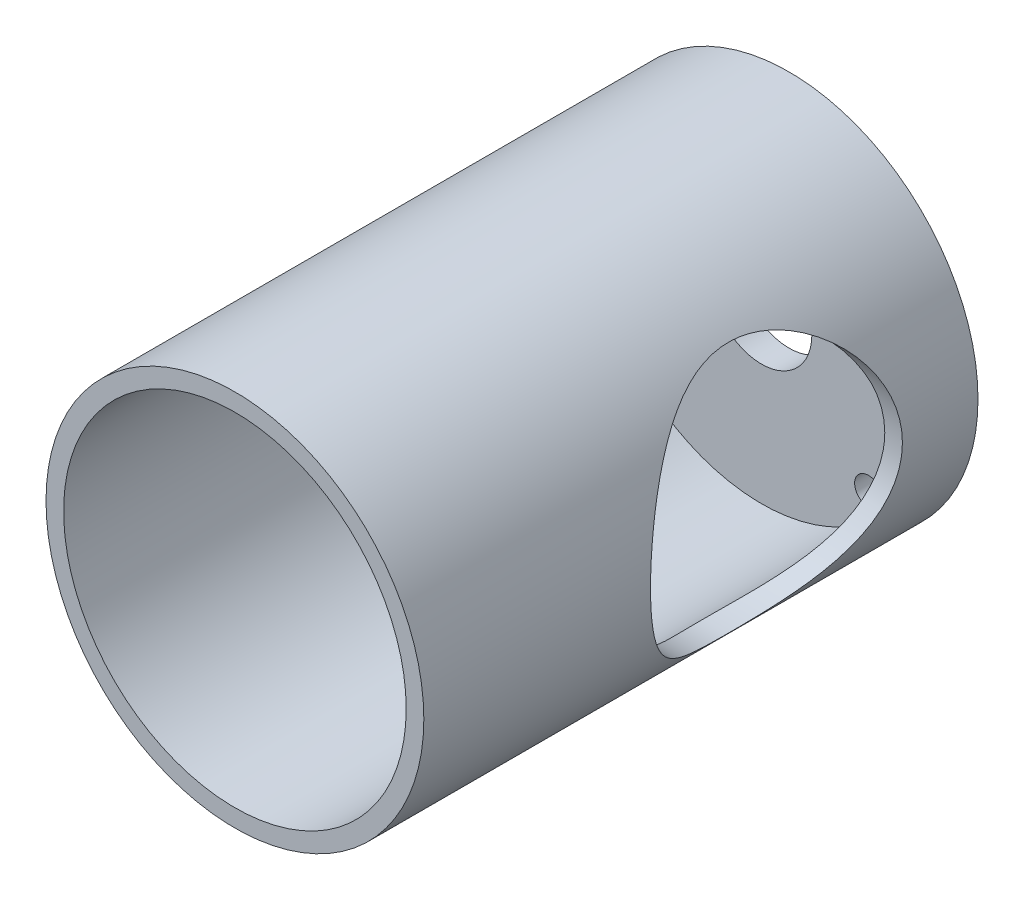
ISO-10303-21;
HEADER;
FILE_DESCRIPTION(('STEP AP214'),'2;1');
FILE_NAME('part.step','',(''),(''),'','','');
FILE_SCHEMA(('AUTOMOTIVE_DESIGN { 1 0 10303 214 1 1 1 1 }'));
ENDSEC;
DATA;
#1=APPLICATION_CONTEXT('core data for automotive mechanical design processes');
#2=APPLICATION_PROTOCOL_DEFINITION('international standard','automotive_design',2000,#1);
#3=PRODUCT_CONTEXT('',#1,'mechanical');
#4=PRODUCT('Part','Part','',(#3));
#5=PRODUCT_RELATED_PRODUCT_CATEGORY('part','',(#4));
#6=PRODUCT_DEFINITION_FORMATION('','',#4);
#7=PRODUCT_DEFINITION_CONTEXT('part definition',#1,'design');
#8=PRODUCT_DEFINITION('design','',#6,#7);
#9=PRODUCT_DEFINITION_SHAPE('','',#8);
#10=(LENGTH_UNIT() NAMED_UNIT(*) SI_UNIT(.MILLI.,.METRE.));
#11=(NAMED_UNIT(*) PLANE_ANGLE_UNIT() SI_UNIT($,.RADIAN.));
#12=(NAMED_UNIT(*) SI_UNIT($,.STERADIAN.) SOLID_ANGLE_UNIT());
#13=UNCERTAINTY_MEASURE_WITH_UNIT(LENGTH_MEASURE(1.E-05),#10,'distance_accuracy_value','');
#14=(GEOMETRIC_REPRESENTATION_CONTEXT(3) GLOBAL_UNCERTAINTY_ASSIGNED_CONTEXT((#13)) GLOBAL_UNIT_ASSIGNED_CONTEXT((#10,
#11,#12)) REPRESENTATION_CONTEXT('',''));
#15=CARTESIAN_POINT('',(0.,0.,0.));
#16=DIRECTION('',(0.,0.,1.));
#17=DIRECTION('',(1.,0.,0.));
#18=AXIS2_PLACEMENT_3D('',#15,#16,#17);
#19=CARTESIAN_POINT('',(0.,0.,3.4798));
#20=DIRECTION('',(0.,0.,-1.));
#21=DIRECTION('',(-1.,0.,0.));
#22=AXIS2_PLACEMENT_3D('',#19,#20,#21);
#23=PLANE('',#22);
#24=CARTESIAN_POINT('',(13.4703841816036,13.4703841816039,3.4798));
#25=DIRECTION('',(0.,0.,-1.));
#26=DIRECTION('',(-1.,0.,0.));
#27=AXIS2_PLACEMENT_3D('',#24,#25,#26);
#28=CIRCLE('',#27,1.7272);
#29=CARTESIAN_POINT('',(11.7431841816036,13.4703841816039,3.4798));
#30=VERTEX_POINT('',#29);
#31=EDGE_CURVE('E117',#30,#30,#28,.T.);
#32=ORIENTED_EDGE('',*,*,#31,.T.);
#33=EDGE_LOOP('',(#32));
#34=FACE_BOUND('',#33,.T.);
#35=CARTESIAN_POINT('',(13.4703841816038,-13.4703841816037,3.4798));
#36=DIRECTION('',(0.,0.,-1.));
#37=DIRECTION('',(-1.,0.,0.));
#38=AXIS2_PLACEMENT_3D('',#35,#36,#37);
#39=CIRCLE('',#38,1.7272);
#40=CARTESIAN_POINT('',(11.7431841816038,-13.4703841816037,3.4798));
#41=VERTEX_POINT('',#40);
#42=EDGE_CURVE('E121',#41,#41,#39,.T.);
#43=ORIENTED_EDGE('',*,*,#42,.T.);
#44=EDGE_LOOP('',(#43));
#45=FACE_BOUND('',#44,.T.);
#46=CARTESIAN_POINT('',(-13.4703841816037,-13.4703841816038,3.4798));
#47=DIRECTION('',(0.,0.,-1.));
#48=DIRECTION('',(-1.,0.,0.));
#49=AXIS2_PLACEMENT_3D('',#46,#47,#48);
#50=CIRCLE('',#49,1.7272);
#51=CARTESIAN_POINT('',(-15.1975841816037,-13.4703841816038,3.4798));
#52=VERTEX_POINT('',#51);
#53=EDGE_CURVE('E125',#52,#52,#50,.T.);
#54=ORIENTED_EDGE('',*,*,#53,.T.);
#55=EDGE_LOOP('',(#54));
#56=FACE_BOUND('',#55,.T.);
#57=CARTESIAN_POINT('',(-13.4703841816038,13.4703841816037,3.4798));
#58=DIRECTION('',(0.,0.,-1.));
#59=DIRECTION('',(-1.,0.,0.));
#60=AXIS2_PLACEMENT_3D('',#57,#58,#59);
#61=CIRCLE('',#60,1.7272);
#62=CARTESIAN_POINT('',(-15.1975841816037,13.4703841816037,3.4798));
#63=VERTEX_POINT('',#62);
#64=EDGE_CURVE('E129',#63,#63,#61,.T.);
#65=ORIENTED_EDGE('',*,*,#64,.T.);
#66=EDGE_LOOP('',(#65));
#67=FACE_BOUND('',#66,.T.);
#68=CARTESIAN_POINT('',(0.,0.,3.4798));
#69=DIRECTION('',(0.,0.,1.));
#70=DIRECTION('',(1.,0.,0.));
#71=AXIS2_PLACEMENT_3D('',#68,#69,#70);
#72=CIRCLE('',#71,6.35);
#73=CARTESIAN_POINT('',(6.35,0.,3.4798));
#74=VERTEX_POINT('',#73);
#75=EDGE_CURVE('E10',#74,#74,#72,.T.);
#76=ORIENTED_EDGE('',*,*,#75,.F.);
#77=EDGE_LOOP('',(#76));
#78=FACE_BOUND('',#77,.T.);
#79=CARTESIAN_POINT('',(0.,0.,3.4798));
#80=DIRECTION('',(0.,0.,1.));
#81=DIRECTION('',(1.,0.,0.));
#82=AXIS2_PLACEMENT_3D('',#79,#80,#81);
#83=CIRCLE('',#82,21.59);
#84=CARTESIAN_POINT('',(21.59,0.,3.4798));
#85=VERTEX_POINT('',#84);
#86=EDGE_CURVE('E133',#85,#85,#83,.T.);
#87=ORIENTED_EDGE('',*,*,#86,.T.);
#88=EDGE_LOOP('',(#87));
#89=FACE_BOUND('',#88,.T.);
#90=ADVANCED_FACE('F40',(#34,#45,#56,#67,#78,#89),#23,.F.);
#91=CARTESIAN_POINT('',(0.,0.,8.82468879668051));
#92=DIRECTION('',(0.,0.,1.));
#93=DIRECTION('',(1.,0.,0.));
#94=AXIS2_PLACEMENT_3D('',#91,#92,#93);
#95=CYLINDRICAL_SURFACE('',#94,6.35);
#96=CARTESIAN_POINT('',(0.,0.,0.));
#97=DIRECTION('',(0.,0.,1.));
#98=DIRECTION('',(1.,0.,0.));
#99=AXIS2_PLACEMENT_3D('',#96,#97,#98);
#100=CIRCLE('',#99,6.35);
#101=CARTESIAN_POINT('',(6.35,0.,0.));
#102=VERTEX_POINT('',#101);
#103=EDGE_CURVE('E52',#102,#102,#100,.T.);
#104=ORIENTED_EDGE('',*,*,#103,.F.);
#105=EDGE_LOOP('',(#104));
#106=FACE_BOUND('',#105,.T.);
#107=ORIENTED_EDGE('',*,*,#75,.T.);
#108=EDGE_LOOP('',(#107));
#109=FACE_BOUND('',#108,.T.);
#110=ADVANCED_FACE('F102',(#106,#109),#95,.F.);
#111=CARTESIAN_POINT('',(0.,0.,0.));
#112=DIRECTION('',(0.,0.,1.));
#113=DIRECTION('',(1.,0.,0.));
#114=AXIS2_PLACEMENT_3D('',#111,#112,#113);
#115=PLANE('',#114);
#116=CARTESIAN_POINT('',(13.4703841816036,13.4703841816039,0.));
#117=DIRECTION('',(0.,0.,-1.));
#118=DIRECTION('',(0.,1.,0.));
#119=AXIS2_PLACEMENT_3D('',#116,#117,#118);
#120=CIRCLE('',#119,1.7272);
#121=CARTESIAN_POINT('',(13.4703841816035,15.1975841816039,0.));
#122=VERTEX_POINT('',#121);
#123=EDGE_CURVE('E173',#122,#122,#120,.T.);
#124=ORIENTED_EDGE('',*,*,#123,.F.);
#125=EDGE_LOOP('',(#124));
#126=FACE_BOUND('',#125,.T.);
#127=CARTESIAN_POINT('',(13.4703841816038,-13.4703841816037,0.));
#128=DIRECTION('',(0.,0.,-1.));
#129=DIRECTION('',(1.,0.,0.));
#130=AXIS2_PLACEMENT_3D('',#127,#128,#129);
#131=CIRCLE('',#130,1.7272);
#132=CARTESIAN_POINT('',(15.1975841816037,-13.4703841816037,0.));
#133=VERTEX_POINT('',#132);
#134=EDGE_CURVE('E177',#133,#133,#131,.T.);
#135=ORIENTED_EDGE('',*,*,#134,.F.);
#136=EDGE_LOOP('',(#135));
#137=FACE_BOUND('',#136,.T.);
#138=CARTESIAN_POINT('',(-13.4703841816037,-13.4703841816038,0.));
#139=DIRECTION('',(0.,0.,-1.));
#140=DIRECTION('',(0.,-1.,0.));
#141=AXIS2_PLACEMENT_3D('',#138,#139,#140);
#142=CIRCLE('',#141,1.7272);
#143=CARTESIAN_POINT('',(-13.4703841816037,-15.1975841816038,0.));
#144=VERTEX_POINT('',#143);
#145=EDGE_CURVE('E183',#144,#144,#142,.T.);
#146=ORIENTED_EDGE('',*,*,#145,.F.);
#147=EDGE_LOOP('',(#146));
#148=FACE_BOUND('',#147,.T.);
#149=CARTESIAN_POINT('',(-13.4703841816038,13.4703841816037,0.));
#150=DIRECTION('',(0.,0.,-1.));
#151=DIRECTION('',(-1.,0.,0.));
#152=AXIS2_PLACEMENT_3D('',#149,#150,#151);
#153=CIRCLE('',#152,1.7272);
#154=CARTESIAN_POINT('',(-15.1975841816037,13.4703841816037,0.));
#155=VERTEX_POINT('',#154);
#156=EDGE_CURVE('E140',#155,#155,#153,.T.);
#157=ORIENTED_EDGE('',*,*,#156,.F.);
#158=EDGE_LOOP('',(#157));
#159=FACE_BOUND('',#158,.T.);
#160=CARTESIAN_POINT('',(0.,0.,0.));
#161=DIRECTION('',(0.,0.,1.));
#162=DIRECTION('',(1.,0.,0.));
#163=AXIS2_PLACEMENT_3D('',#160,#161,#162);
#164=CIRCLE('',#163,23.8125);
#165=CARTESIAN_POINT('',(23.8125,0.,0.));
#166=VERTEX_POINT('',#165);
#167=EDGE_CURVE('E57',#166,#166,#164,.T.);
#168=ORIENTED_EDGE('',*,*,#167,.F.);
#169=EDGE_LOOP('',(#168));
#170=FACE_BOUND('',#169,.T.);
#171=ORIENTED_EDGE('',*,*,#103,.T.);
#172=EDGE_LOOP('',(#171));
#173=FACE_BOUND('',#172,.T.);
#174=ADVANCED_FACE('F98',(#126,#137,#148,#159,#170,#173),#115,.F.);
#175=CARTESIAN_POINT('',(0.,0.,8.82468879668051));
#176=DIRECTION('',(0.,0.,1.));
#177=DIRECTION('',(1.,0.,0.));
#178=AXIS2_PLACEMENT_3D('',#175,#176,#177);
#179=CYLINDRICAL_SURFACE('',#178,23.8125);
#180=CARTESIAN_POINT('',(-23.8125,0.,9.525));
#181=CARTESIAN_POINT('',(-23.8124998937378,0.398805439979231,9.52500010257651));
#182=CARTESIAN_POINT('',(-23.8024600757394,0.797612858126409,9.54004799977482));
#183=CARTESIAN_POINT('',(-23.7625536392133,1.59196771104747,9.60000246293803));
#184=CARTESIAN_POINT('',(-23.7326869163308,1.98751512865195,9.64490918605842));
#185=CARTESIAN_POINT('',(-23.6538493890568,2.77240106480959,9.76391852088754));
#186=CARTESIAN_POINT('',(-23.6048711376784,3.16173710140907,9.83803251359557));
#187=CARTESIAN_POINT('',(-23.4889753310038,3.93123475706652,10.0143948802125));
#188=CARTESIAN_POINT('',(-23.4220575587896,4.31139626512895,10.1166435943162));
#189=CARTESIAN_POINT('',(-23.272150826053,5.05831725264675,10.3473881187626));
#190=CARTESIAN_POINT('',(-23.1892401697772,5.42513208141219,10.4757562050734));
#191=CARTESIAN_POINT('',(-23.0088815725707,6.14526862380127,10.7575678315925));
#192=CARTESIAN_POINT('',(-22.9114337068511,6.49859040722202,10.911011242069));
#193=CARTESIAN_POINT('',(-22.7039083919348,7.19013452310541,11.2414529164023));
#194=CARTESIAN_POINT('',(-22.5938314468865,7.52835745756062,11.4184502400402));
#195=CARTESIAN_POINT('',(-22.3630438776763,8.18851201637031,11.7945507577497));
#196=CARTESIAN_POINT('',(-22.2423318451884,8.51044147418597,11.993656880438));
#197=CARTESIAN_POINT('',(-21.9817615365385,9.16357915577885,12.4303594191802));
#198=CARTESIAN_POINT('',(-21.8411476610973,9.49326067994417,12.6697878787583));
#199=CARTESIAN_POINT('',(-21.5525870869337,10.1313261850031,13.1714843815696));
#200=CARTESIAN_POINT('',(-21.4046400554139,10.439709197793,13.4337534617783));
#201=CARTESIAN_POINT('',(-21.1040173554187,11.0348029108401,13.9801859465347));
#202=CARTESIAN_POINT('',(-20.951335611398,11.321483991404,14.2643782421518));
#203=CARTESIAN_POINT('',(-20.6443663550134,11.8720108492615,14.8532718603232));
#204=CARTESIAN_POINT('',(-20.4900787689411,12.1358555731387,15.157974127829));
#205=CARTESIAN_POINT('',(-20.1587390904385,12.6797924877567,15.8367193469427));
#206=CARTESIAN_POINT('',(-19.9819391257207,12.9558721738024,16.2141143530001));
#207=CARTESIAN_POINT('',(-19.6355445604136,13.4750871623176,16.9942146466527));
#208=CARTESIAN_POINT('',(-19.4659516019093,13.718214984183,17.3969256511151));
#209=CARTESIAN_POINT('',(-19.1400542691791,14.1693617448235,18.2259348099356));
#210=CARTESIAN_POINT('',(-18.9837320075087,14.3774283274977,18.6521998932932));
#211=CARTESIAN_POINT('',(-18.690606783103,14.7564835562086,19.5272740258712));
#212=CARTESIAN_POINT('',(-18.5537944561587,14.9274900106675,19.9760721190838));
#213=CARTESIAN_POINT('',(-18.3422522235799,15.1860539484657,20.7613042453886));
#214=CARTESIAN_POINT('',(-18.2610024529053,15.2834498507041,21.092768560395));
#215=CARTESIAN_POINT('',(-18.1143124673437,15.4570298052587,21.764598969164));
#216=CARTESIAN_POINT('',(-18.0488679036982,15.5332196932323,22.1049625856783));
#217=CARTESIAN_POINT('',(-17.9361181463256,15.6632769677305,22.7924027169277));
#218=CARTESIAN_POINT('',(-17.8887871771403,15.7171760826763,23.1394689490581));
#219=CARTESIAN_POINT('',(-17.8139528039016,15.8019448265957,23.8385528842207));
#220=CARTESIAN_POINT('',(-17.7864495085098,15.8328143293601,24.1905706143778));
#221=CARTESIAN_POINT('',(-17.7523440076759,15.8710463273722,24.898370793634));
#222=CARTESIAN_POINT('',(-17.7458288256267,15.8783109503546,25.2541627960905));
#223=CARTESIAN_POINT('',(-17.7542270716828,15.8689197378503,25.96517433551));
#224=CARTESIAN_POINT('',(-17.7691405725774,15.85226382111,26.3203938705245));
#225=CARTESIAN_POINT('',(-17.8197737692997,15.7953237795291,27.0276836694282));
#226=CARTESIAN_POINT('',(-17.8555089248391,15.7550220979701,27.3797513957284));
#227=CARTESIAN_POINT('',(-17.9463367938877,15.6514814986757,28.0779338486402));
#228=CARTESIAN_POINT('',(-18.0014298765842,15.5882421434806,28.4240484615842));
#229=CARTESIAN_POINT('',(-18.1260766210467,15.4430955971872,29.0930060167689));
#230=CARTESIAN_POINT('',(-18.1948768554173,15.3621454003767,29.4161988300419));
#231=CARTESIAN_POINT('',(-18.3461889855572,15.1811211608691,30.0539434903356));
#232=CARTESIAN_POINT('',(-18.4287061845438,15.0810397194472,30.3684919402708));
#233=CARTESIAN_POINT('',(-18.6935272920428,14.753502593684,31.297507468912));
#234=CARTESIAN_POINT('',(-18.8931715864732,14.4986750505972,31.8977024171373));
#235=CARTESIAN_POINT('',(-19.2359414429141,14.0378205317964,32.8233780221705));
#236=CARTESIAN_POINT('',(-19.3699426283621,13.8527281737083,33.1631328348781));
#237=CARTESIAN_POINT('',(-19.6451087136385,13.459657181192,33.8262496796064));
#238=CARTESIAN_POINT('',(-19.7862742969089,13.2516763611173,34.1496101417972));
#239=CARTESIAN_POINT('',(-20.0727841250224,12.813551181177,34.7795490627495));
#240=CARTESIAN_POINT('',(-20.2181327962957,12.5833826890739,35.0861086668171));
#241=CARTESIAN_POINT('',(-20.5100208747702,12.1017975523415,35.6814744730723));
#242=CARTESIAN_POINT('',(-20.6565603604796,11.8503794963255,35.9702794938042));
#243=CARTESIAN_POINT('',(-20.9796462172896,11.2704138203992,36.5897352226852));
#244=CARTESIAN_POINT('',(-21.1558447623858,10.9369291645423,36.9159691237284));
#245=CARTESIAN_POINT('',(-21.5015716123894,10.240545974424,37.539411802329));
#246=CARTESIAN_POINT('',(-21.6710986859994,9.87764204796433,37.8366152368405));
#247=CARTESIAN_POINT('',(-21.9990583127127,9.12388454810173,38.399667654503));
#248=CARTESIAN_POINT('',(-22.1574989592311,8.73305179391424,38.6655396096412));
#249=CARTESIAN_POINT('',(-22.3837241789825,8.12715083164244,39.0389641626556));
#250=CARTESIAN_POINT('',(-22.457222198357,7.9219225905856,39.1592014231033));
#251=CARTESIAN_POINT('',(-22.5999492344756,7.50506439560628,39.3909440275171));
#252=CARTESIAN_POINT('',(-22.6691771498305,7.29343281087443,39.5024471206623));
#253=CARTESIAN_POINT('',(-22.8434484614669,6.73368841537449,39.7812948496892));
#254=CARTESIAN_POINT('',(-22.94470744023,6.38075055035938,39.9414233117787));
#255=CARTESIAN_POINT('',(-23.1328363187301,5.66086836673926,40.2364920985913));
#256=CARTESIAN_POINT('',(-23.2197089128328,5.29392668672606,40.371437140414));
#257=CARTESIAN_POINT('',(-23.3772283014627,4.54812936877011,40.6145932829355));
#258=CARTESIAN_POINT('',(-23.447885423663,4.16928148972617,40.7228214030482));
#259=CARTESIAN_POINT('',(-23.5714627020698,3.40181663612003,40.9112664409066));
#260=CARTESIAN_POINT('',(-23.6243825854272,3.01319951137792,40.9914829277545));
#261=CARTESIAN_POINT('',(-23.711422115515,2.22724141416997,41.1230549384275));
#262=CARTESIAN_POINT('',(-23.7454585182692,1.8298697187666,41.1742826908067));
#263=CARTESIAN_POINT('',(-23.7935259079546,1.03117637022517,41.2465477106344));
#264=CARTESIAN_POINT('',(-23.807556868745,0.629854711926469,41.2675849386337));
#265=CARTESIAN_POINT('',(-23.8152557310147,-0.173406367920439,41.2791338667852));
#266=CARTESIAN_POINT('',(-23.8089244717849,-0.575345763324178,41.2696468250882));
#267=CARTESIAN_POINT('',(-23.7760615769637,-1.3765066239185,41.2203006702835));
#268=CARTESIAN_POINT('',(-23.7495308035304,-1.77572820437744,41.1804428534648));
#269=CARTESIAN_POINT('',(-23.6795004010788,-2.54033477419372,41.074841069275));
#270=CARTESIAN_POINT('',(-23.637326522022,-2.9061236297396,41.0111164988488));
#271=CARTESIAN_POINT('',(-23.5369978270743,-3.63021687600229,40.8587845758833));
#272=CARTESIAN_POINT('',(-23.4788439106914,-3.98852168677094,40.7701786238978));
#273=CARTESIAN_POINT('',(-23.3477154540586,-4.69559963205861,40.5691163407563));
#274=CARTESIAN_POINT('',(-23.2747399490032,-5.04437214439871,40.456658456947));
#275=CARTESIAN_POINT('',(-23.1153497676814,-5.73060818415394,40.2090794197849));
#276=CARTESIAN_POINT('',(-23.0289343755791,-6.06807110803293,40.0739570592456));
#277=CARTESIAN_POINT('',(-22.8386075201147,-6.75026176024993,39.7734752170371));
#278=CARTESIAN_POINT('',(-22.73395384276,-7.09419379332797,39.6067809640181));
#279=CARTESIAN_POINT('',(-22.5132130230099,-7.76630806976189,39.2508024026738));
#280=CARTESIAN_POINT('',(-22.3971255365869,-8.09448983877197,39.0615174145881));
#281=CARTESIAN_POINT('',(-22.1555007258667,-8.73417969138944,38.661676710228));
#282=CARTESIAN_POINT('',(-22.029959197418,-9.04568025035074,38.4511115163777));
#283=CARTESIAN_POINT('',(-21.7715593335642,-9.6510467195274,38.0100439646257));
#284=CARTESIAN_POINT('',(-21.6387001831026,-9.94491065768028,37.7795393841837));
#285=CARTESIAN_POINT('',(-21.3463885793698,-10.5593631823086,37.2617626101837));
#286=CARTESIAN_POINT('',(-21.1860530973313,-10.8768295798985,36.9712775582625));
#287=CARTESIAN_POINT('',(-20.8618917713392,-11.4863311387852,36.3665027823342));
#288=CARTESIAN_POINT('',(-20.6980654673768,-11.7783629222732,36.0522099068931));
#289=CARTESIAN_POINT('',(-20.3704618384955,-12.3362942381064,35.4007755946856));
#290=CARTESIAN_POINT('',(-20.2066846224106,-12.6021758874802,35.0636187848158));
#291=CARTESIAN_POINT('',(-19.8832201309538,-13.1065806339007,34.367600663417));
#292=CARTESIAN_POINT('',(-19.7235324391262,-13.3451065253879,34.0087415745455));
#293=CARTESIAN_POINT('',(-19.4256837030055,-13.774628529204,33.3013706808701));
#294=CARTESIAN_POINT('',(-19.2868441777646,-13.967938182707,32.9545497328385));
#295=CARTESIAN_POINT('',(-19.0197904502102,-14.3294533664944,32.2440658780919));
#296=CARTESIAN_POINT('',(-18.891576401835,-14.4976585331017,31.8804027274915));
#297=CARTESIAN_POINT('',(-18.6498857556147,-14.8072769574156,31.1377500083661));
#298=CARTESIAN_POINT('',(-18.5363876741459,-14.9487294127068,30.758783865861));
#299=CARTESIAN_POINT('',(-18.3280519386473,-15.203446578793,29.9865056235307));
#300=CARTESIAN_POINT('',(-18.2332099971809,-15.3167177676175,29.5931968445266));
#301=CARTESIAN_POINT('',(-18.0812634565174,-15.495620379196,28.8662924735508));
#302=CARTESIAN_POINT('',(-18.0204396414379,-15.5661557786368,28.5346775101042));
#303=CARTESIAN_POINT('',(-17.9160895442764,-15.6861480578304,27.8649657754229));
#304=CARTESIAN_POINT('',(-17.8725611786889,-15.7356074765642,27.5268697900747));
#305=CARTESIAN_POINT('',(-17.8044318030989,-15.8126539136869,26.8466023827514));
#306=CARTESIAN_POINT('',(-17.7798133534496,-15.8402610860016,26.5044350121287));
#307=CARTESIAN_POINT('',(-17.7504051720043,-15.873209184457,25.8181625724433));
#308=CARTESIAN_POINT('',(-17.7456157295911,-15.8785497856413,25.4740574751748));
#309=CARTESIAN_POINT('',(-17.7560644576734,-15.8668645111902,24.786339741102));
#310=CARTESIAN_POINT('',(-17.7713140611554,-15.8498258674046,24.4427274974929));
#311=CARTESIAN_POINT('',(-17.8212467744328,-15.7936606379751,23.7587610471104));
#312=CARTESIAN_POINT('',(-17.8559297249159,-15.7545342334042,23.4184068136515));
#313=CARTESIAN_POINT('',(-17.9434536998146,-15.6547760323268,22.7428725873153));
#314=CARTESIAN_POINT('',(-17.9963145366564,-15.594120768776,22.4076986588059));
#315=CARTESIAN_POINT('',(-18.1183375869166,-15.4521757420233,21.7447474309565));
#316=CARTESIAN_POINT('',(-18.1875034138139,-15.3708814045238,21.416971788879));
#317=CARTESIAN_POINT('',(-18.3602962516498,-15.1643435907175,20.6841473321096));
#318=CARTESIAN_POINT('',(-18.4681951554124,-15.0331614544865,20.2817723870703));
#319=CARTESIAN_POINT('',(-18.7020420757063,-14.7412250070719,19.4933280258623));
#320=CARTESIAN_POINT('',(-18.8279950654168,-14.5804625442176,19.1072631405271));
#321=CARTESIAN_POINT('',(-19.0935367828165,-14.2309596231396,18.3524050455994));
#322=CARTESIAN_POINT('',(-19.2331400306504,-14.042189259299,17.9836308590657));
#323=CARTESIAN_POINT('',(-19.5216305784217,-13.6382800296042,17.2647094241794));
#324=CARTESIAN_POINT('',(-19.6705173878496,-13.4231425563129,16.9145611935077));
#325=CARTESIAN_POINT('',(-19.9764852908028,-12.9635174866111,16.2273888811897));
#326=CARTESIAN_POINT('',(-20.1336661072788,-12.718567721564,15.890718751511));
#327=CARTESIAN_POINT('',(-20.4499547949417,-12.2035176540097,15.2381816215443));
#328=CARTESIAN_POINT('',(-20.60906266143,-11.9334174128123,14.9223145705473));
#329=CARTESIAN_POINT('',(-20.9258298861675,-11.3687997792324,14.3122229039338));
#330=CARTESIAN_POINT('',(-21.0834888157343,-11.0742754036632,14.0180045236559));
#331=CARTESIAN_POINT('',(-21.394093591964,-10.4616391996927,13.452467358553));
#332=CARTESIAN_POINT('',(-21.5470390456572,-10.1435254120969,13.1811504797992));
#333=CARTESIAN_POINT('',(-21.8665684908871,-9.43712817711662,12.6255678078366));
#334=CARTESIAN_POINT('',(-22.0319503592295,-9.04533290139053,12.3450518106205));
#335=CARTESIAN_POINT('',(-22.3480184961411,-8.23352670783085,11.8184410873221));
#336=CARTESIAN_POINT('',(-22.4987026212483,-7.81351168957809,11.5723513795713));
#337=CARTESIAN_POINT('',(-22.7808368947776,-6.9480575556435,11.1178892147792));
#338=CARTESIAN_POINT('',(-22.9123106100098,-6.5026505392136,10.9094704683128));
#339=CARTESIAN_POINT('',(-23.1521060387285,-5.58908812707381,10.5332075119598));
#340=CARTESIAN_POINT('',(-23.2604358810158,-5.1209407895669,10.3653490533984));
#341=CARTESIAN_POINT('',(-23.4292011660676,-4.27214309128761,10.1057089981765));
#342=CARTESIAN_POINT('',(-23.494930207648,-3.89515704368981,10.0053108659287));
#343=CARTESIAN_POINT('',(-23.6087392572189,-3.13228544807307,9.83217063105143));
#344=CARTESIAN_POINT('',(-23.6568221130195,-2.74640134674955,9.75942406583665));
#345=CARTESIAN_POINT('',(-23.7341956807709,-1.96868694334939,9.64263901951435));
#346=CARTESIAN_POINT('',(-23.7634979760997,-1.5768604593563,9.59858284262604));
#347=CARTESIAN_POINT('',(-23.8026505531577,-0.790023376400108,9.53976273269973));
#348=CARTESIAN_POINT('',(-23.8125001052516,-0.395012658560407,9.52499989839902));
#349=CARTESIAN_POINT('',(-23.8125,0.,9.525));
#350=B_SPLINE_CURVE_WITH_KNOTS('',3,(#180,#181,#182,#183,#184,#185,#186,#187,#188,#189,#190,
#191,#192,#193,#194,#195,#196,#197,#198,#199,#200,#201,#202,#203,#204,#205,#206,#207,#208,#209,
#210,#211,#212,#213,#214,#215,#216,#217,#218,#219,#220,#221,#222,#223,#224,#225,#226,#227,#228,
#229,#230,#231,#232,#233,#234,#235,#236,#237,#238,#239,#240,#241,#242,#243,#244,#245,#246,#247,
#248,#249,#250,#251,#252,#253,#254,#255,#256,#257,#258,#259,#260,#261,#262,#263,#264,#265,#266,
#267,#268,#269,#270,#271,#272,#273,#274,#275,#276,#277,#278,#279,#280,#281,#282,#283,#284,#285,
#286,#287,#288,#289,#290,#291,#292,#293,#294,#295,#296,#297,#298,#299,#300,#301,#302,#303,#304,
#305,#306,#307,#308,#309,#310,#311,#312,#313,#314,#315,#316,#317,#318,#319,#320,#321,#322,#323,
#324,#325,#326,#327,#328,#329,#330,#331,#332,#333,#334,#335,#336,#337,#338,#339,#340,#341,#342,
#343,#344,#345,#346,#347,#348,#349),.UNSPECIFIED.,.T.,.F.,(4,2,2,2,2,2,2,2,2,2,2,2,2,2,2,2,2,2,
2,2,2,2,2,2,2,2,2,2,2,2,2,2,2,2,2,2,2,2,2,2,2,2,2,2,2,2,2,2,2,2,2,2,2,2,2,2,2,2,2,2,2,2,2,2,2,2,
2,2,2,2,2,2,2,2,2,2,2,2,2,2,2,2,2,2,4),(0.,1.19601345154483,2.39203319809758,3.58851945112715,
4.78502017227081,5.97580484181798,7.1665833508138,8.35731434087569,9.54820324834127,
10.8400409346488,12.1319373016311,13.4255662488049,14.7192548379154,16.2172109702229,
17.7155065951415,19.2117495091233,20.7072718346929,21.7710069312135,22.8344490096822,
23.8963721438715,24.9583010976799,26.0246275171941,27.0909575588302,28.1580803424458,
29.2252234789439,30.2448328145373,31.2648372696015,33.30373667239,34.5312660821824,
35.7589128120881,36.9879101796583,38.2169892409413,39.7112673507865,41.2058199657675,
42.699269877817,43.4458972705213,44.1927164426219,45.3931250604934,46.5933086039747,
47.7927256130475,48.9921610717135,50.1968428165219,51.4015261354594,52.6061598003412,
53.8107420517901,54.9305419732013,56.0502788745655,57.17008868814,58.2899581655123,
59.4775803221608,60.6652382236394,61.853427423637,63.0417492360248,64.4179814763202,
65.7943962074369,67.1717457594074,68.5489544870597,69.8097108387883,71.0704854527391,
72.3293982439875,73.5880213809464,74.6203108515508,75.6524759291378,76.6836879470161,
77.7149150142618,78.7467306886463,79.7785379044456,80.8114732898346,81.8446378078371,
83.1530113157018,84.4617459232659,85.771888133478,87.0819611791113,88.4158324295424,
89.749700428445,91.0839511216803,92.4183127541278,93.9445851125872,95.4710797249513,
96.9956856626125,98.5197552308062,99.7052729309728,100.890599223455,102.075193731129,
103.259832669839),.UNSPECIFIED.);
#351=CARTESIAN_POINT('',(-23.8125,0.,9.525));
#352=VERTEX_POINT('',#351);
#353=EDGE_CURVE('E88',#352,#352,#350,.T.);
#354=ORIENTED_EDGE('',*,*,#353,.T.);
#355=EDGE_LOOP('',(#354));
#356=FACE_BOUND('',#355,.T.);
#357=CARTESIAN_POINT('',(23.8125,0.,9.525));
#358=CARTESIAN_POINT('',(23.8124998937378,-0.398805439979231,9.52500010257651));
#359=CARTESIAN_POINT('',(23.8024600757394,-0.79761285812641,9.54004799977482));
#360=CARTESIAN_POINT('',(23.7625536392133,-1.59196771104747,9.60000246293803));
#361=CARTESIAN_POINT('',(23.7326869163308,-1.98751512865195,9.64490918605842));
#362=CARTESIAN_POINT('',(23.6538493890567,-2.77240106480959,9.76391852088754));
#363=CARTESIAN_POINT('',(23.6048711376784,-3.16173710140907,9.83803251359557));
#364=CARTESIAN_POINT('',(23.4889753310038,-3.93123475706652,10.0143948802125));
#365=CARTESIAN_POINT('',(23.4220575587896,-4.31139626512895,10.1166435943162));
#366=CARTESIAN_POINT('',(23.272150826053,-5.05831725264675,10.3473881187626));
#367=CARTESIAN_POINT('',(23.1892401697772,-5.42513208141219,10.4757562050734));
#368=CARTESIAN_POINT('',(23.0088815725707,-6.14526862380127,10.7575678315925));
#369=CARTESIAN_POINT('',(22.9114337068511,-6.49859040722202,10.911011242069));
#370=CARTESIAN_POINT('',(22.7039083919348,-7.19013452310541,11.2414529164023));
#371=CARTESIAN_POINT('',(22.5938314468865,-7.52835745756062,11.4184502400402));
#372=CARTESIAN_POINT('',(22.3630438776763,-8.18851201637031,11.7945507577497));
#373=CARTESIAN_POINT('',(22.2423318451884,-8.51044147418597,11.993656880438));
#374=CARTESIAN_POINT('',(21.9817615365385,-9.16357915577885,12.4303594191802));
#375=CARTESIAN_POINT('',(21.8411476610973,-9.49326067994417,12.6697878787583));
#376=CARTESIAN_POINT('',(21.5525870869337,-10.1313261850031,13.1714843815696));
#377=CARTESIAN_POINT('',(21.4046400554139,-10.439709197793,13.4337534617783));
#378=CARTESIAN_POINT('',(21.1040173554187,-11.0348029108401,13.9801859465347));
#379=CARTESIAN_POINT('',(20.951335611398,-11.321483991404,14.2643782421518));
#380=CARTESIAN_POINT('',(20.6443663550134,-11.8720108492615,14.8532718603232));
#381=CARTESIAN_POINT('',(20.4900787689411,-12.1358555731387,15.157974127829));
#382=CARTESIAN_POINT('',(20.1587390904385,-12.6797924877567,15.8367193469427));
#383=CARTESIAN_POINT('',(19.9819391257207,-12.9558721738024,16.2141143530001));
#384=CARTESIAN_POINT('',(19.6355445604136,-13.4750871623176,16.9942146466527));
#385=CARTESIAN_POINT('',(19.4659516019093,-13.718214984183,17.3969256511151));
#386=CARTESIAN_POINT('',(19.1400542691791,-14.1693617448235,18.2259348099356));
#387=CARTESIAN_POINT('',(18.9837320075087,-14.3774283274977,18.6521998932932));
#388=CARTESIAN_POINT('',(18.690606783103,-14.7564835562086,19.5272740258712));
#389=CARTESIAN_POINT('',(18.5537944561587,-14.9274900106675,19.9760721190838));
#390=CARTESIAN_POINT('',(18.3422522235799,-15.1860539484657,20.7613042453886));
#391=CARTESIAN_POINT('',(18.2610024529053,-15.2834498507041,21.092768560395));
#392=CARTESIAN_POINT('',(18.1143124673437,-15.4570298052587,21.764598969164));
#393=CARTESIAN_POINT('',(18.0488679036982,-15.5332196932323,22.1049625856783));
#394=CARTESIAN_POINT('',(17.9361181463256,-15.6632769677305,22.7924027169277));
#395=CARTESIAN_POINT('',(17.8887871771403,-15.7171760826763,23.1394689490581));
#396=CARTESIAN_POINT('',(17.8139528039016,-15.8019448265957,23.8385528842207));
#397=CARTESIAN_POINT('',(17.7864495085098,-15.8328143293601,24.1905706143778));
#398=CARTESIAN_POINT('',(17.7523440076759,-15.8710463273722,24.898370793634));
#399=CARTESIAN_POINT('',(17.7458288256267,-15.8783109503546,25.2541627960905));
#400=CARTESIAN_POINT('',(17.7542270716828,-15.8689197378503,25.96517433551));
#401=CARTESIAN_POINT('',(17.7691405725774,-15.85226382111,26.3203938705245));
#402=CARTESIAN_POINT('',(17.8197737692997,-15.7953237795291,27.0276836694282));
#403=CARTESIAN_POINT('',(17.8555089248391,-15.7550220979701,27.3797513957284));
#404=CARTESIAN_POINT('',(17.9463367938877,-15.6514814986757,28.0779338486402));
#405=CARTESIAN_POINT('',(18.0014298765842,-15.5882421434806,28.4240484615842));
#406=CARTESIAN_POINT('',(18.1260766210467,-15.4430955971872,29.0930060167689));
#407=CARTESIAN_POINT('',(18.1948768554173,-15.3621454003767,29.4161988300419));
#408=CARTESIAN_POINT('',(18.3461889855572,-15.1811211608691,30.0539434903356));
#409=CARTESIAN_POINT('',(18.4287061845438,-15.0810397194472,30.3684919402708));
#410=CARTESIAN_POINT('',(18.6935272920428,-14.753502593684,31.297507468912));
#411=CARTESIAN_POINT('',(18.8931715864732,-14.4986750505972,31.8977024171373));
#412=CARTESIAN_POINT('',(19.2359414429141,-14.0378205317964,32.8233780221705));
#413=CARTESIAN_POINT('',(19.3699426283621,-13.8527281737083,33.1631328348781));
#414=CARTESIAN_POINT('',(19.6451087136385,-13.459657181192,33.8262496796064));
#415=CARTESIAN_POINT('',(19.7862742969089,-13.2516763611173,34.1496101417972));
#416=CARTESIAN_POINT('',(20.0727841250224,-12.813551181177,34.7795490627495));
#417=CARTESIAN_POINT('',(20.2181327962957,-12.5833826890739,35.0861086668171));
#418=CARTESIAN_POINT('',(20.5100208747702,-12.1017975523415,35.6814744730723));
#419=CARTESIAN_POINT('',(20.6565603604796,-11.8503794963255,35.9702794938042));
#420=CARTESIAN_POINT('',(20.9796462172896,-11.2704138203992,36.5897352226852));
#421=CARTESIAN_POINT('',(21.1558447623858,-10.9369291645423,36.9159691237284));
#422=CARTESIAN_POINT('',(21.5015716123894,-10.240545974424,37.539411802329));
#423=CARTESIAN_POINT('',(21.6710986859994,-9.87764204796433,37.8366152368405));
#424=CARTESIAN_POINT('',(21.9990583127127,-9.12388454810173,38.399667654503));
#425=CARTESIAN_POINT('',(22.1574989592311,-8.73305179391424,38.6655396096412));
#426=CARTESIAN_POINT('',(22.3837241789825,-8.12715083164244,39.0389641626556));
#427=CARTESIAN_POINT('',(22.457222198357,-7.9219225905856,39.1592014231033));
#428=CARTESIAN_POINT('',(22.5999492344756,-7.50506439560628,39.3909440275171));
#429=CARTESIAN_POINT('',(22.6691771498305,-7.29343281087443,39.5024471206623));
#430=CARTESIAN_POINT('',(22.8434484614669,-6.73368841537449,39.7812948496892));
#431=CARTESIAN_POINT('',(22.94470744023,-6.38075055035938,39.9414233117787));
#432=CARTESIAN_POINT('',(23.1328363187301,-5.66086836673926,40.2364920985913));
#433=CARTESIAN_POINT('',(23.2197089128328,-5.29392668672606,40.371437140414));
#434=CARTESIAN_POINT('',(23.3772283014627,-4.54812936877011,40.6145932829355));
#435=CARTESIAN_POINT('',(23.447885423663,-4.16928148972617,40.7228214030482));
#436=CARTESIAN_POINT('',(23.5714627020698,-3.40181663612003,40.9112664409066));
#437=CARTESIAN_POINT('',(23.6243825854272,-3.01319951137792,40.9914829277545));
#438=CARTESIAN_POINT('',(23.711422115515,-2.22724141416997,41.1230549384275));
#439=CARTESIAN_POINT('',(23.7454585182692,-1.8298697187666,41.1742826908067));
#440=CARTESIAN_POINT('',(23.7935259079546,-1.03117637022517,41.2465477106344));
#441=CARTESIAN_POINT('',(23.807556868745,-0.629854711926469,41.2675849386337));
#442=CARTESIAN_POINT('',(23.8152557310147,0.173406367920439,41.2791338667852));
#443=CARTESIAN_POINT('',(23.8089244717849,0.575345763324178,41.2696468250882));
#444=CARTESIAN_POINT('',(23.7760615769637,1.3765066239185,41.2203006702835));
#445=CARTESIAN_POINT('',(23.7495308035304,1.77572820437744,41.1804428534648));
#446=CARTESIAN_POINT('',(23.6795004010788,2.54033477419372,41.074841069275));
#447=CARTESIAN_POINT('',(23.637326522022,2.9061236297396,41.0111164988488));
#448=CARTESIAN_POINT('',(23.5369978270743,3.63021687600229,40.8587845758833));
#449=CARTESIAN_POINT('',(23.4788439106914,3.98852168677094,40.7701786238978));
#450=CARTESIAN_POINT('',(23.3477154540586,4.69559963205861,40.5691163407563));
#451=CARTESIAN_POINT('',(23.2747399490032,5.04437214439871,40.456658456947));
#452=CARTESIAN_POINT('',(23.1153497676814,5.73060818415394,40.2090794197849));
#453=CARTESIAN_POINT('',(23.0289343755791,6.06807110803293,40.0739570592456));
#454=CARTESIAN_POINT('',(22.8386075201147,6.75026176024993,39.7734752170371));
#455=CARTESIAN_POINT('',(22.73395384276,7.09419379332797,39.6067809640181));
#456=CARTESIAN_POINT('',(22.5132130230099,7.76630806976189,39.2508024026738));
#457=CARTESIAN_POINT('',(22.3971255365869,8.09448983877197,39.0615174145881));
#458=CARTESIAN_POINT('',(22.1555007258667,8.73417969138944,38.661676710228));
#459=CARTESIAN_POINT('',(22.029959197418,9.04568025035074,38.4511115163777));
#460=CARTESIAN_POINT('',(21.7715593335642,9.6510467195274,38.0100439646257));
#461=CARTESIAN_POINT('',(21.6387001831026,9.94491065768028,37.7795393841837));
#462=CARTESIAN_POINT('',(21.3463885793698,10.5593631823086,37.2617626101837));
#463=CARTESIAN_POINT('',(21.1860530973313,10.8768295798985,36.9712775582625));
#464=CARTESIAN_POINT('',(20.8618917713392,11.4863311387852,36.3665027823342));
#465=CARTESIAN_POINT('',(20.6980654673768,11.7783629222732,36.0522099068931));
#466=CARTESIAN_POINT('',(20.3704618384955,12.3362942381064,35.4007755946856));
#467=CARTESIAN_POINT('',(20.2066846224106,12.6021758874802,35.0636187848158));
#468=CARTESIAN_POINT('',(19.8832201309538,13.1065806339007,34.367600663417));
#469=CARTESIAN_POINT('',(19.7235324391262,13.3451065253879,34.0087415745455));
#470=CARTESIAN_POINT('',(19.4256837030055,13.774628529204,33.3013706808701));
#471=CARTESIAN_POINT('',(19.2868441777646,13.967938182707,32.9545497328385));
#472=CARTESIAN_POINT('',(19.0197904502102,14.3294533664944,32.2440658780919));
#473=CARTESIAN_POINT('',(18.891576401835,14.4976585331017,31.8804027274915));
#474=CARTESIAN_POINT('',(18.6498857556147,14.8072769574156,31.1377500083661));
#475=CARTESIAN_POINT('',(18.5363876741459,14.9487294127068,30.758783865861));
#476=CARTESIAN_POINT('',(18.3280519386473,15.203446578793,29.9865056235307));
#477=CARTESIAN_POINT('',(18.2332099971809,15.3167177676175,29.5931968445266));
#478=CARTESIAN_POINT('',(18.0812634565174,15.495620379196,28.8662924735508));
#479=CARTESIAN_POINT('',(18.0204396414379,15.5661557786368,28.5346775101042));
#480=CARTESIAN_POINT('',(17.9160895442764,15.6861480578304,27.8649657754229));
#481=CARTESIAN_POINT('',(17.8725611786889,15.7356074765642,27.5268697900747));
#482=CARTESIAN_POINT('',(17.8044318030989,15.8126539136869,26.8466023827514));
#483=CARTESIAN_POINT('',(17.7798133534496,15.8402610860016,26.5044350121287));
#484=CARTESIAN_POINT('',(17.7504051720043,15.873209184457,25.8181625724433));
#485=CARTESIAN_POINT('',(17.7456157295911,15.8785497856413,25.4740574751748));
#486=CARTESIAN_POINT('',(17.7560644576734,15.8668645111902,24.786339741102));
#487=CARTESIAN_POINT('',(17.7713140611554,15.8498258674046,24.4427274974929));
#488=CARTESIAN_POINT('',(17.8212467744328,15.7936606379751,23.7587610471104));
#489=CARTESIAN_POINT('',(17.8559297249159,15.7545342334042,23.4184068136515));
#490=CARTESIAN_POINT('',(17.9434536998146,15.6547760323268,22.7428725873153));
#491=CARTESIAN_POINT('',(17.9963145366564,15.594120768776,22.4076986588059));
#492=CARTESIAN_POINT('',(18.1183375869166,15.4521757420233,21.7447474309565));
#493=CARTESIAN_POINT('',(18.1875034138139,15.3708814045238,21.416971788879));
#494=CARTESIAN_POINT('',(18.3602962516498,15.1643435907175,20.6841473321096));
#495=CARTESIAN_POINT('',(18.4681951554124,15.0331614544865,20.2817723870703));
#496=CARTESIAN_POINT('',(18.7020420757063,14.7412250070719,19.4933280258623));
#497=CARTESIAN_POINT('',(18.8279950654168,14.5804625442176,19.1072631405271));
#498=CARTESIAN_POINT('',(19.0935367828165,14.2309596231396,18.3524050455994));
#499=CARTESIAN_POINT('',(19.2331400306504,14.042189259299,17.9836308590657));
#500=CARTESIAN_POINT('',(19.5216305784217,13.6382800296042,17.2647094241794));
#501=CARTESIAN_POINT('',(19.6705173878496,13.4231425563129,16.9145611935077));
#502=CARTESIAN_POINT('',(19.9764852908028,12.9635174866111,16.2273888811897));
#503=CARTESIAN_POINT('',(20.1336661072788,12.718567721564,15.890718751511));
#504=CARTESIAN_POINT('',(20.4499547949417,12.2035176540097,15.2381816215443));
#505=CARTESIAN_POINT('',(20.60906266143,11.9334174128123,14.9223145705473));
#506=CARTESIAN_POINT('',(20.9258298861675,11.3687997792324,14.3122229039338));
#507=CARTESIAN_POINT('',(21.0834888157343,11.0742754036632,14.0180045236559));
#508=CARTESIAN_POINT('',(21.394093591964,10.4616391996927,13.452467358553));
#509=CARTESIAN_POINT('',(21.5470390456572,10.1435254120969,13.1811504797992));
#510=CARTESIAN_POINT('',(21.8665684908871,9.43712817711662,12.6255678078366));
#511=CARTESIAN_POINT('',(22.0319503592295,9.04533290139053,12.3450518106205));
#512=CARTESIAN_POINT('',(22.3480184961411,8.23352670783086,11.8184410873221));
#513=CARTESIAN_POINT('',(22.4987026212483,7.81351168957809,11.5723513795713));
#514=CARTESIAN_POINT('',(22.7808368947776,6.94805755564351,11.1178892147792));
#515=CARTESIAN_POINT('',(22.9123106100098,6.50265053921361,10.9094704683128));
#516=CARTESIAN_POINT('',(23.1521060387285,5.58908812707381,10.5332075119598));
#517=CARTESIAN_POINT('',(23.2604358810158,5.1209407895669,10.3653490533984));
#518=CARTESIAN_POINT('',(23.4292011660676,4.27214309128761,10.1057089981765));
#519=CARTESIAN_POINT('',(23.494930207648,3.89515704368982,10.0053108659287));
#520=CARTESIAN_POINT('',(23.6087392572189,3.13228544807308,9.83217063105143));
#521=CARTESIAN_POINT('',(23.6568221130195,2.74640134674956,9.75942406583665));
#522=CARTESIAN_POINT('',(23.7341956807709,1.96868694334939,9.64263901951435));
#523=CARTESIAN_POINT('',(23.7634979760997,1.5768604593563,9.59858284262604));
#524=CARTESIAN_POINT('',(23.8026505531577,0.790023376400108,9.53976273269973));
#525=CARTESIAN_POINT('',(23.8125001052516,0.395012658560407,9.52499989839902));
#526=CARTESIAN_POINT('',(23.8125,0.,9.525));
#527=B_SPLINE_CURVE_WITH_KNOTS('',3,(#357,#358,#359,#360,#361,#362,#363,#364,#365,#366,#367,
#368,#369,#370,#371,#372,#373,#374,#375,#376,#377,#378,#379,#380,#381,#382,#383,#384,#385,#386,
#387,#388,#389,#390,#391,#392,#393,#394,#395,#396,#397,#398,#399,#400,#401,#402,#403,#404,#405,
#406,#407,#408,#409,#410,#411,#412,#413,#414,#415,#416,#417,#418,#419,#420,#421,#422,#423,#424,
#425,#426,#427,#428,#429,#430,#431,#432,#433,#434,#435,#436,#437,#438,#439,#440,#441,#442,#443,
#444,#445,#446,#447,#448,#449,#450,#451,#452,#453,#454,#455,#456,#457,#458,#459,#460,#461,#462,
#463,#464,#465,#466,#467,#468,#469,#470,#471,#472,#473,#474,#475,#476,#477,#478,#479,#480,#481,
#482,#483,#484,#485,#486,#487,#488,#489,#490,#491,#492,#493,#494,#495,#496,#497,#498,#499,#500,
#501,#502,#503,#504,#505,#506,#507,#508,#509,#510,#511,#512,#513,#514,#515,#516,#517,#518,#519,
#520,#521,#522,#523,#524,#525,#526),.UNSPECIFIED.,.T.,.F.,(4,2,2,2,2,2,2,2,2,2,2,2,2,2,2,2,2,2,
2,2,2,2,2,2,2,2,2,2,2,2,2,2,2,2,2,2,2,2,2,2,2,2,2,2,2,2,2,2,2,2,2,2,2,2,2,2,2,2,2,2,2,2,2,2,2,2,
2,2,2,2,2,2,2,2,2,2,2,2,2,2,2,2,2,2,4),(0.,1.19601345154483,2.39203319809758,3.58851945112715,
4.78502017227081,5.97580484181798,7.1665833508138,8.35731434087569,9.54820324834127,
10.8400409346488,12.1319373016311,13.4255662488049,14.7192548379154,16.2172109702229,
17.7155065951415,19.2117495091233,20.7072718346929,21.7710069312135,22.8344490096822,
23.8963721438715,24.9583010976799,26.0246275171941,27.0909575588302,28.1580803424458,
29.2252234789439,30.2448328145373,31.2648372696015,33.30373667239,34.5312660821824,
35.7589128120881,36.9879101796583,38.2169892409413,39.7112673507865,41.2058199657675,
42.699269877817,43.4458972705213,44.1927164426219,45.3931250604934,46.5933086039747,
47.7927256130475,48.9921610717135,50.1968428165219,51.4015261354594,52.6061598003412,
53.8107420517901,54.9305419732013,56.0502788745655,57.17008868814,58.2899581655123,
59.4775803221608,60.6652382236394,61.853427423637,63.0417492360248,64.4179814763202,
65.7943962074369,67.1717457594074,68.5489544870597,69.8097108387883,71.0704854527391,
72.3293982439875,73.5880213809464,74.6203108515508,75.6524759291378,76.6836879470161,
77.7149150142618,78.7467306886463,79.7785379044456,80.8114732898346,81.8446378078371,
83.1530113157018,84.4617459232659,85.771888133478,87.0819611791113,88.4158324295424,
89.749700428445,91.0839511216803,92.4183127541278,93.9445851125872,95.4710797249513,
96.9956856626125,98.5197552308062,99.7052729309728,100.890599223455,102.075193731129,
103.259832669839),.UNSPECIFIED.);
#528=CARTESIAN_POINT('',(23.8125,0.,9.525));
#529=VERTEX_POINT('',#528);
#530=EDGE_CURVE('E82',#529,#529,#527,.T.);
#531=ORIENTED_EDGE('',*,*,#530,.T.);
#532=EDGE_LOOP('',(#531));
#533=FACE_BOUND('',#532,.T.);
#534=CARTESIAN_POINT('',(0.,0.,69.85));
#535=DIRECTION('',(0.,0.,1.));
#536=DIRECTION('',(1.,0.,0.));
#537=AXIS2_PLACEMENT_3D('',#534,#535,#536);
#538=CIRCLE('',#537,23.8125);
#539=CARTESIAN_POINT('',(23.8125,0.,69.85));
#540=VERTEX_POINT('',#539);
#541=EDGE_CURVE('E138',#540,#540,#538,.T.);
#542=ORIENTED_EDGE('',*,*,#541,.F.);
#543=EDGE_LOOP('',(#542));
#544=FACE_BOUND('',#543,.T.);
#545=ORIENTED_EDGE('',*,*,#167,.T.);
#546=EDGE_LOOP('',(#545));
#547=FACE_BOUND('',#546,.T.);
#548=ADVANCED_FACE('F93',(#356,#533,#544,#547),#179,.T.);
#549=CARTESIAN_POINT('',(0.,0.,69.85));
#550=DIRECTION('',(0.,0.,-1.));
#551=DIRECTION('',(-1.,0.,0.));
#552=AXIS2_PLACEMENT_3D('',#549,#550,#551);
#553=PLANE('',#552);
#554=CARTESIAN_POINT('',(0.,0.,69.85));
#555=DIRECTION('',(0.,0.,1.));
#556=DIRECTION('',(1.,0.,0.));
#557=AXIS2_PLACEMENT_3D('',#554,#555,#556);
#558=CIRCLE('',#557,21.59);
#559=CARTESIAN_POINT('',(21.59,0.,69.85));
#560=VERTEX_POINT('',#559);
#561=EDGE_CURVE('E135',#560,#560,#558,.T.);
#562=ORIENTED_EDGE('',*,*,#561,.F.);
#563=EDGE_LOOP('',(#562));
#564=FACE_BOUND('',#563,.T.);
#565=ORIENTED_EDGE('',*,*,#541,.T.);
#566=EDGE_LOOP('',(#565));
#567=FACE_BOUND('',#566,.T.);
#568=ADVANCED_FACE('F97',(#564,#567),#553,.F.);
#569=CARTESIAN_POINT('',(0.,0.,8.82468879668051));
#570=DIRECTION('',(0.,0.,1.));
#571=DIRECTION('',(1.,0.,0.));
#572=AXIS2_PLACEMENT_3D('',#569,#570,#571);
#573=CYLINDRICAL_SURFACE('',#572,21.59);
#574=CARTESIAN_POINT('',(21.59,0.,9.525));
#575=CARTESIAN_POINT('',(21.5899963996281,0.389583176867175,9.52500374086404));
#576=CARTESIAN_POINT('',(21.579429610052,0.779256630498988,9.53936647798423));
#577=CARTESIAN_POINT('',(21.537401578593,1.55553852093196,9.59659663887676));
#578=CARTESIAN_POINT('',(21.5059281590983,1.9421450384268,9.63948067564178));
#579=CARTESIAN_POINT('',(21.4227463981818,2.70987617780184,9.75317624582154));
#580=CARTESIAN_POINT('',(21.370994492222,3.09098715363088,9.82404790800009));
#581=CARTESIAN_POINT('',(21.2484615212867,3.84402323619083,9.99259961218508));
#582=CARTESIAN_POINT('',(21.1776829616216,4.21594954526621,10.0902761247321));
#583=CARTESIAN_POINT('',(21.0191084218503,4.94610272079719,10.3103932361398));
#584=CARTESIAN_POINT('',(20.9314170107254,5.30439835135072,10.4326818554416));
#585=CARTESIAN_POINT('',(20.7404913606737,6.00773905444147,10.7008716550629));
#586=CARTESIAN_POINT('',(20.63725665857,6.35278373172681,10.8467735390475));
#587=CARTESIAN_POINT('',(20.4171946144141,7.02796478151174,11.160552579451));
#588=CARTESIAN_POINT('',(20.3003741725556,7.35810860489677,11.3284185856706));
#589=CARTESIAN_POINT('',(20.0550550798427,8.00261175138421,11.6847001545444));
#590=CARTESIAN_POINT('',(19.9265547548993,8.31696880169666,11.8731186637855));
#591=CARTESIAN_POINT('',(19.6476980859,8.95705336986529,12.2872159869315));
#592=CARTESIAN_POINT('',(19.4964176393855,9.281192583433,12.5147264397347));
#593=CARTESIAN_POINT('',(19.1849901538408,9.90893746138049,12.9909775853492));
#594=CARTESIAN_POINT('',(19.0248426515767,10.2125420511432,13.2397193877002));
#595=CARTESIAN_POINT('',(18.6981290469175,10.7991167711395,13.7574930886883));
#596=CARTESIAN_POINT('',(18.5315540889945,11.0820567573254,14.0265535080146));
#597=CARTESIAN_POINT('',(18.1949717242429,11.6264152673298,14.5836335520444));
#598=CARTESIAN_POINT('',(18.0249640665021,11.8878322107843,14.8716545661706));
#599=CARTESIAN_POINT('',(17.6511442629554,12.4376929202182,15.5240050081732));
#600=CARTESIAN_POINT('',(17.447218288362,12.7214354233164,15.8922475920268));
#601=CARTESIAN_POINT('',(17.0440494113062,13.2567256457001,16.6540501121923));
#602=CARTESIAN_POINT('',(16.8448078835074,13.5082640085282,17.0476173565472));
#603=CARTESIAN_POINT('',(16.4575515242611,13.9774642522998,17.8590745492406));
#604=CARTESIAN_POINT('',(16.269524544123,14.1951632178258,18.2769371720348));
#605=CARTESIAN_POINT('',(15.9118667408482,14.5949471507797,19.1367995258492));
#606=CARTESIAN_POINT('',(15.7422256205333,14.7770520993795,19.5787855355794));
#607=CARTESIAN_POINT('',(15.4821370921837,15.0483935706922,20.3340072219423));
#608=CARTESIAN_POINT('',(15.3841821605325,15.1483174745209,20.6408482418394));
#609=CARTESIAN_POINT('',(15.2029616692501,15.330183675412,21.2640144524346));
#610=CARTESIAN_POINT('',(15.1196914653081,15.4121316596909,21.5803366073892));
#611=CARTESIAN_POINT('',(14.9707408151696,15.5568574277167,22.2207909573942));
#612=CARTESIAN_POINT('',(14.9050276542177,15.6196708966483,22.5449073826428));
#613=CARTESIAN_POINT('',(14.7935534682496,15.7252916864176,23.1998160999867));
#614=CARTESIAN_POINT('',(14.7477923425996,15.7680991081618,23.5306083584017));
#615=CARTESIAN_POINT('',(14.6779745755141,15.8331135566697,24.1992344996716));
#616=CARTESIAN_POINT('',(14.6540952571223,15.8551523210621,24.5371036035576));
#617=CARTESIAN_POINT('',(14.6298464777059,15.8775304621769,25.214400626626));
#618=CARTESIAN_POINT('',(14.6294760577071,15.8778707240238,25.5538284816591));
#619=CARTESIAN_POINT('',(14.652268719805,15.8568393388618,26.2314010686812));
#620=CARTESIAN_POINT('',(14.6754452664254,15.8354552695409,26.5695449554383));
#621=CARTESIAN_POINT('',(14.7442134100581,15.7714440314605,27.241504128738));
#622=CARTESIAN_POINT('',(14.7898074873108,15.7288145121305,27.5753189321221));
#623=CARTESIAN_POINT('',(14.907286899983,15.6175576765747,28.2713348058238));
#624=CARTESIAN_POINT('',(14.9814506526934,15.5466496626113,28.6327842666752));
#625=CARTESIAN_POINT('',(15.1511205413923,15.3813401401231,29.3450947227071));
#626=CARTESIAN_POINT('',(15.2466296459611,15.2869353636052,29.6959542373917));
#627=CARTESIAN_POINT('',(15.4553193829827,15.0759157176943,30.3862747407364));
#628=CARTESIAN_POINT('',(15.5685344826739,14.9592574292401,30.7257118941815));
#629=CARTESIAN_POINT('',(15.8087298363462,14.7051940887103,31.3916560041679));
#630=CARTESIAN_POINT('',(15.9357114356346,14.5677870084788,31.7181616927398));
#631=CARTESIAN_POINT('',(16.2467461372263,14.2212155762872,32.4710643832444));
#632=CARTESIAN_POINT('',(16.4350960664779,14.0038635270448,32.8919318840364));
#633=CARTESIAN_POINT('',(16.823183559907,13.535185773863,33.7088042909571));
#634=CARTESIAN_POINT('',(17.0229248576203,13.2838488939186,34.1048009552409));
#635=CARTESIAN_POINT('',(17.4275803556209,12.7483444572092,34.8717611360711));
#636=CARTESIAN_POINT('',(17.6324992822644,12.4641459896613,35.2427005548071));
#637=CARTESIAN_POINT('',(18.0417211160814,11.8640762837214,35.9582822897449));
#638=CARTESIAN_POINT('',(18.2460240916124,11.5482087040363,36.3029276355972));
#639=CARTESIAN_POINT('',(18.6519567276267,10.8805996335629,36.9695244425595));
#640=CARTESIAN_POINT('',(18.8535031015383,10.5283995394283,37.2910684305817));
#641=CARTESIAN_POINT('',(19.2458334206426,9.79284443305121,37.9037987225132));
#642=CARTESIAN_POINT('',(19.4366162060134,9.40948607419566,38.1949817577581));
#643=CARTESIAN_POINT('',(19.8022373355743,8.61340975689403,38.7438347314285));
#644=CARTESIAN_POINT('',(19.9771059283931,8.20075026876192,39.0015686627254));
#645=CARTESIAN_POINT('',(20.2240866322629,7.56086980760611,39.3609719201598));
#646=CARTESIAN_POINT('',(20.3038530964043,7.3441156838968,39.4762305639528));
#647=CARTESIAN_POINT('',(20.4577556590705,6.90381931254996,39.6973284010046));
#648=CARTESIAN_POINT('',(20.5318903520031,6.68027538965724,39.8031652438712));
#649=CARTESIAN_POINT('',(20.708584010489,6.11617208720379,40.0541584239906));
#650=CARTESIAN_POINT('',(20.8073694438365,5.77172142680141,40.1933130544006));
#651=CARTESIAN_POINT('',(20.9893120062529,5.07031803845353,40.4481460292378));
#652=CARTESIAN_POINT('',(21.0724725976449,4.71336810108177,40.5638295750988));
#653=CARTESIAN_POINT('',(21.2215165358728,3.988981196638,40.7702762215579));
#654=CARTESIAN_POINT('',(21.2874088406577,3.62154977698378,40.8610522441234));
#655=CARTESIAN_POINT('',(21.4005714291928,2.8783533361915,41.0164920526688));
#656=CARTESIAN_POINT('',(21.4478412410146,2.50258810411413,41.0811551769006));
#657=CARTESIAN_POINT('',(21.5228430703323,1.74390362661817,41.1835839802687));
#658=CARTESIAN_POINT('',(21.5504955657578,1.36096164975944,41.2212401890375));
#659=CARTESIAN_POINT('',(21.5852982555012,0.592417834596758,41.2686132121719));
#660=CARTESIAN_POINT('',(21.5924484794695,0.206816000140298,41.2783300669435));
#661=CARTESIAN_POINT('',(21.5860750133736,-0.563899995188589,41.2696618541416));
#662=CARTESIAN_POINT('',(21.5725511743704,-0.949014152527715,41.2512765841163));
#663=CARTESIAN_POINT('',(21.5251529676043,-1.71562422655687,41.1867101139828));
#664=CARTESIAN_POINT('',(21.491279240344,-2.09712025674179,41.1405297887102));
#665=CARTESIAN_POINT('',(21.4066939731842,-2.83003386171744,41.0248366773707));
#666=CARTESIAN_POINT('',(21.3571596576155,-3.18184730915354,40.9569522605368));
#667=CARTESIAN_POINT('',(21.2418728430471,-3.87753155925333,40.7983004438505));
#668=CARTESIAN_POINT('',(21.1761211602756,-4.22140276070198,40.7075341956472));
#669=CARTESIAN_POINT('',(21.0296107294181,-4.89937547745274,40.5042053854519));
#670=CARTESIAN_POINT('',(20.9488504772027,-5.23347600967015,40.3916406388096));
#671=CARTESIAN_POINT('',(20.7737230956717,-5.89033873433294,40.1459323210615));
#672=CARTESIAN_POINT('',(20.6793551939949,-6.21310028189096,40.0127875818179));
#673=CARTESIAN_POINT('',(20.4706669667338,-6.87081159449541,39.7159954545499));
#674=CARTESIAN_POINT('',(20.3553632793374,-7.20473949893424,39.55077666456));
#675=CARTESIAN_POINT('',(20.1126819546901,-7.85679146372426,39.1994073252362));
#676=CARTESIAN_POINT('',(19.9853038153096,-8.17491486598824,39.0132559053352));
#677=CARTESIAN_POINT('',(19.7204508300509,-8.79462985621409,38.6213682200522));
#678=CARTESIAN_POINT('',(19.5829718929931,-9.09621465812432,38.4156240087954));
#679=CARTESIAN_POINT('',(19.3000074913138,-9.68213229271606,37.9858639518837));
#680=CARTESIAN_POINT('',(19.1545210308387,-9.96646297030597,37.7618458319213));
#681=CARTESIAN_POINT('',(18.8304158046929,-10.56790455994,37.2539882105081));
#682=CARTESIAN_POINT('',(18.6506103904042,-10.881476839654,36.9667083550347));
#683=CARTESIAN_POINT('',(18.2862256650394,-11.4832843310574,36.369483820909));
#684=CARTESIAN_POINT('',(18.1016456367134,-11.7715157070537,36.0595357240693));
#685=CARTESIAN_POINT('',(17.7312813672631,-12.3223370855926,35.4177164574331));
#686=CARTESIAN_POINT('',(17.5454961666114,-12.5849030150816,35.0858251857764));
#687=CARTESIAN_POINT('',(17.1769701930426,-13.0834185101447,34.4010624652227));
#688=CARTESIAN_POINT('',(16.9942290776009,-13.319371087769,34.0481933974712));
#689=CARTESIAN_POINT('',(16.6532700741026,-13.7427597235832,33.3561794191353));
#690=CARTESIAN_POINT('',(16.4943665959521,-13.9326734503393,33.0188884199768));
#691=CARTESIAN_POINT('',(16.1866665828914,-14.2889932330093,32.3275898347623));
#692=CARTESIAN_POINT('',(16.0378705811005,-14.4553980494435,31.9735813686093));
#693=CARTESIAN_POINT('',(15.7551030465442,-14.7630760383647,31.2499154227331));
#694=CARTESIAN_POINT('',(15.6211043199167,-14.9043956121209,30.8802884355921));
#695=CARTESIAN_POINT('',(15.3725625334,-15.1606175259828,30.1254690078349));
#696=CARTESIAN_POINT('',(15.2580206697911,-15.2755182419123,29.7402756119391));
#697=CARTESIAN_POINT('',(15.0777181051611,-15.4532383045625,29.0481556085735));
#698=CARTESIAN_POINT('',(15.0068177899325,-15.5219519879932,28.7440755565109));
#699=CARTESIAN_POINT('',(14.8818835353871,-15.6417758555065,28.129191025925));
#700=CARTESIAN_POINT('',(14.8278396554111,-15.6928964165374,27.8183906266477));
#701=CARTESIAN_POINT('',(14.7386442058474,-15.7766989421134,27.191961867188));
#702=CARTESIAN_POINT('',(14.7034715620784,-15.8094014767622,26.8763392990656));
#703=CARTESIAN_POINT('',(14.6533839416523,-15.8558386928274,26.2420793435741));
#704=CARTESIAN_POINT('',(14.638468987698,-15.8695733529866,25.9234419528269));
#705=CARTESIAN_POINT('',(14.6295436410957,-15.877801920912,25.2848029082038));
#706=CARTESIAN_POINT('',(14.6355869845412,-15.8722463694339,24.9647998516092));
#707=CARTESIAN_POINT('',(14.6684260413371,-15.8419022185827,24.3267972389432));
#708=CARTESIAN_POINT('',(14.695221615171,-15.8171137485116,24.0087976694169));
#709=CARTESIAN_POINT('',(14.7684557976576,-15.7487556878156,23.3767643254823));
#710=CARTESIAN_POINT('',(14.8149169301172,-15.7051645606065,23.0627355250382));
#711=CARTESIAN_POINT('',(14.9256487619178,-15.5999652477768,22.440912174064));
#712=CARTESIAN_POINT('',(14.9899219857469,-15.5383545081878,22.1331185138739));
#713=CARTESIAN_POINT('',(15.1542767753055,-15.3783153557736,21.4398714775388));
#714=CARTESIAN_POINT('',(15.2593455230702,-15.2744069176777,21.0568609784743));
#715=CARTESIAN_POINT('',(15.4900057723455,-15.040437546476,20.305305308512));
#716=CARTESIAN_POINT('',(15.6156034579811,-14.9103687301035,19.9367645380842));
#717=CARTESIAN_POINT('',(15.8827386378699,-14.6254882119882,19.214387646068));
#718=CARTESIAN_POINT('',(16.0243104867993,-14.4706228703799,18.8605855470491));
#719=CARTESIAN_POINT('',(16.3187534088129,-14.1377433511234,18.1690156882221));
#720=CARTESIAN_POINT('',(16.4716247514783,-13.9597286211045,17.8312483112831));
#721=CARTESIAN_POINT('',(16.8285339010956,-13.5287506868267,17.0798471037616));
#722=CARTESIAN_POINT('',(17.0349391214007,-13.2687396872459,16.6713662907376));
#723=CARTESIAN_POINT('',(17.4528935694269,-12.7139814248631,15.8814228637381));
#724=CARTESIAN_POINT('',(17.664444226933,-12.4192244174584,15.4999678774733));
#725=CARTESIAN_POINT('',(18.0864555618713,-11.7961749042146,14.7652583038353));
#726=CARTESIAN_POINT('',(18.2969167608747,-11.4679003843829,14.4119887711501));
#727=CARTESIAN_POINT('',(18.7113145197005,-10.7785199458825,13.7349919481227));
#728=CARTESIAN_POINT('',(18.9152527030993,-10.4174222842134,13.411257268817));
#729=CARTESIAN_POINT('',(19.2807309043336,-9.72168331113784,12.8431805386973));
#730=CARTESIAN_POINT('',(19.4439440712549,-9.39161233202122,12.5943093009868));
#731=CARTESIAN_POINT('',(19.7589803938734,-8.70930237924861,12.1208409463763));
#732=CARTESIAN_POINT('',(19.9108038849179,-8.3570640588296,11.8962431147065));
#733=CARTESIAN_POINT('',(20.1999181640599,-7.63175631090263,11.4734793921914));
#734=CARTESIAN_POINT('',(20.3372201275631,-7.25870324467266,11.2752931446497));
#735=CARTESIAN_POINT('',(20.5944416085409,-6.49307727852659,10.9073863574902));
#736=CARTESIAN_POINT('',(20.7143644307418,-6.10050810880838,10.7376604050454));
#737=CARTESIAN_POINT('',(20.9172941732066,-5.3590462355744,10.4524531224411));
#738=CARTESIAN_POINT('',(21.0031416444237,-5.01258978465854,10.3326477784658));
#739=CARTESIAN_POINT('',(21.158713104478,-4.30891246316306,10.1165351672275));
#740=CARTESIAN_POINT('',(21.2284398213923,-3.95169342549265,10.0202239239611));
#741=CARTESIAN_POINT('',(21.350259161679,-3.22930883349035,9.85251129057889));
#742=CARTESIAN_POINT('',(21.4023885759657,-2.86416157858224,9.78105792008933));
#743=CARTESIAN_POINT('',(21.4880901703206,-2.12775519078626,9.66382659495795));
#744=CARTESIAN_POINT('',(21.5216719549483,-1.75649932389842,9.61803535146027));
#745=CARTESIAN_POINT('',(21.5603752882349,-1.15384849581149,9.56530782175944));
#746=CARTESIAN_POINT('',(21.5714740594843,-0.923508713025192,9.55020297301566));
#747=CARTESIAN_POINT('',(21.5862879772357,-0.46212326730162,9.53004727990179));
#748=CARTESIAN_POINT('',(21.5900021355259,-0.231077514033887,9.52499778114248));
#749=CARTESIAN_POINT('',(21.59,0.,9.525));
#750=B_SPLINE_CURVE_WITH_KNOTS('',3,(#574,#575,#576,#577,#578,#579,#580,#581,#582,#583,#584,
#585,#586,#587,#588,#589,#590,#591,#592,#593,#594,#595,#596,#597,#598,#599,#600,#601,#602,#603,
#604,#605,#606,#607,#608,#609,#610,#611,#612,#613,#614,#615,#616,#617,#618,#619,#620,#621,#622,
#623,#624,#625,#626,#627,#628,#629,#630,#631,#632,#633,#634,#635,#636,#637,#638,#639,#640,#641,
#642,#643,#644,#645,#646,#647,#648,#649,#650,#651,#652,#653,#654,#655,#656,#657,#658,#659,#660,
#661,#662,#663,#664,#665,#666,#667,#668,#669,#670,#671,#672,#673,#674,#675,#676,#677,#678,#679,
#680,#681,#682,#683,#684,#685,#686,#687,#688,#689,#690,#691,#692,#693,#694,#695,#696,#697,#698,
#699,#700,#701,#702,#703,#704,#705,#706,#707,#708,#709,#710,#711,#712,#713,#714,#715,#716,#717,
#718,#719,#720,#721,#722,#723,#724,#725,#726,#727,#728,#729,#730,#731,#732,#733,#734,#735,#736,
#737,#738,#739,#740,#741,#742,#743,#744,#745,#746,#747,#748,#749),.UNSPECIFIED.,.T.,.F.,(4,2,2,
2,2,2,2,2,2,2,2,2,2,2,2,2,2,2,2,2,2,2,2,2,2,2,2,2,2,2,2,2,2,2,2,2,2,2,2,2,2,2,2,2,2,2,2,2,2,2,2,
2,2,2,2,2,2,2,2,2,2,2,2,2,2,2,2,2,2,2,2,2,2,2,2,2,2,2,2,2,2,2,2,2,2,2,2,4),(0.,1.16850199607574,
2.33768521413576,3.50939409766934,4.68094877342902,5.84547960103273,7.01004513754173,
8.17402175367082,9.33816546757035,10.6087482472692,11.8793974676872,13.1518646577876,
14.4244251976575,15.9456627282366,17.4673412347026,18.9873401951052,20.5064834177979,
21.5174030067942,22.5280022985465,23.5367051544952,24.5454029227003,25.5622043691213,
26.5789643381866,27.5963060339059,28.6137603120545,29.7392998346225,30.8649959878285,
31.99291138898,33.1209371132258,34.6480659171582,36.1756981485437,37.7047791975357,
39.2336837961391,40.7850352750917,42.3365536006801,43.8850584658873,44.6591662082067,
45.433466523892,46.5854463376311,47.7371705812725,48.8882961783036,50.0394509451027,
51.1952458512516,52.3510390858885,53.5068406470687,54.6626058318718,55.7465449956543,
56.8304296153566,57.9144229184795,58.9984777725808,60.1673401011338,61.3362510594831,
62.5056381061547,63.675170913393,65.0589817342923,66.4430016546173,67.8283075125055,
69.2134564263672,70.4677183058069,71.7220462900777,72.9740293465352,74.2260893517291,
75.1843184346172,76.1419813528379,77.098572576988,78.0551648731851,79.0142116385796,
79.9732519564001,80.9333936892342,81.8936715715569,83.1233998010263,84.3534991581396,
85.5862963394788,86.819122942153,88.3962101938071,89.9737408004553,91.5504292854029,
93.1267222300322,94.4587691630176,95.7907768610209,97.1217519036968,98.4524735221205,
99.5808347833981,100.70900495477,101.83480162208,102.96001476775,103.653007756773,
104.346093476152),.UNSPECIFIED.);
#751=CARTESIAN_POINT('',(21.59,0.,9.525));
#752=VERTEX_POINT('',#751);
#753=EDGE_CURVE('E43',#752,#752,#750,.T.);
#754=ORIENTED_EDGE('',*,*,#753,.T.);
#755=EDGE_LOOP('',(#754));
#756=FACE_BOUND('',#755,.T.);
#757=CARTESIAN_POINT('',(-21.59,0.,9.525));
#758=CARTESIAN_POINT('',(-21.5899963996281,-0.389583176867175,9.52500374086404));
#759=CARTESIAN_POINT('',(-21.579429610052,-0.779256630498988,9.53936647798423));
#760=CARTESIAN_POINT('',(-21.537401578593,-1.55553852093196,9.59659663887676));
#761=CARTESIAN_POINT('',(-21.5059281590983,-1.9421450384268,9.63948067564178));
#762=CARTESIAN_POINT('',(-21.4227463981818,-2.70987617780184,9.75317624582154));
#763=CARTESIAN_POINT('',(-21.370994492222,-3.09098715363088,9.82404790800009));
#764=CARTESIAN_POINT('',(-21.2484615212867,-3.84402323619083,9.99259961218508));
#765=CARTESIAN_POINT('',(-21.1776829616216,-4.21594954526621,10.0902761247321));
#766=CARTESIAN_POINT('',(-21.0191084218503,-4.94610272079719,10.3103932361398));
#767=CARTESIAN_POINT('',(-20.9314170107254,-5.30439835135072,10.4326818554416));
#768=CARTESIAN_POINT('',(-20.7404913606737,-6.00773905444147,10.7008716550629));
#769=CARTESIAN_POINT('',(-20.63725665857,-6.35278373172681,10.8467735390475));
#770=CARTESIAN_POINT('',(-20.4171946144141,-7.02796478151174,11.160552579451));
#771=CARTESIAN_POINT('',(-20.3003741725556,-7.35810860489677,11.3284185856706));
#772=CARTESIAN_POINT('',(-20.0550550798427,-8.00261175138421,11.6847001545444));
#773=CARTESIAN_POINT('',(-19.9265547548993,-8.31696880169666,11.8731186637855));
#774=CARTESIAN_POINT('',(-19.6476980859,-8.95705336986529,12.2872159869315));
#775=CARTESIAN_POINT('',(-19.4964176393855,-9.281192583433,12.5147264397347));
#776=CARTESIAN_POINT('',(-19.1849901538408,-9.90893746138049,12.9909775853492));
#777=CARTESIAN_POINT('',(-19.0248426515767,-10.2125420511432,13.2397193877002));
#778=CARTESIAN_POINT('',(-18.6981290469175,-10.7991167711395,13.7574930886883));
#779=CARTESIAN_POINT('',(-18.5315540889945,-11.0820567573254,14.0265535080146));
#780=CARTESIAN_POINT('',(-18.1949717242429,-11.6264152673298,14.5836335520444));
#781=CARTESIAN_POINT('',(-18.0249640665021,-11.8878322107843,14.8716545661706));
#782=CARTESIAN_POINT('',(-17.6511442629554,-12.4376929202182,15.5240050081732));
#783=CARTESIAN_POINT('',(-17.447218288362,-12.7214354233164,15.8922475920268));
#784=CARTESIAN_POINT('',(-17.0440494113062,-13.2567256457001,16.6540501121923));
#785=CARTESIAN_POINT('',(-16.8448078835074,-13.5082640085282,17.0476173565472));
#786=CARTESIAN_POINT('',(-16.4575515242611,-13.9774642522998,17.8590745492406));
#787=CARTESIAN_POINT('',(-16.269524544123,-14.1951632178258,18.2769371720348));
#788=CARTESIAN_POINT('',(-15.9118667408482,-14.5949471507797,19.1367995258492));
#789=CARTESIAN_POINT('',(-15.7422256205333,-14.7770520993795,19.5787855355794));
#790=CARTESIAN_POINT('',(-15.4821370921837,-15.0483935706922,20.3340072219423));
#791=CARTESIAN_POINT('',(-15.3841821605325,-15.1483174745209,20.6408482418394));
#792=CARTESIAN_POINT('',(-15.2029616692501,-15.330183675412,21.2640144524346));
#793=CARTESIAN_POINT('',(-15.1196914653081,-15.4121316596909,21.5803366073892));
#794=CARTESIAN_POINT('',(-14.9707408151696,-15.5568574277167,22.2207909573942));
#795=CARTESIAN_POINT('',(-14.9050276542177,-15.6196708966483,22.5449073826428));
#796=CARTESIAN_POINT('',(-14.7935534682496,-15.7252916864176,23.1998160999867));
#797=CARTESIAN_POINT('',(-14.7477923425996,-15.7680991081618,23.5306083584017));
#798=CARTESIAN_POINT('',(-14.6779745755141,-15.8331135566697,24.1992344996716));
#799=CARTESIAN_POINT('',(-14.6540952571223,-15.8551523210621,24.5371036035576));
#800=CARTESIAN_POINT('',(-14.6298464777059,-15.8775304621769,25.214400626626));
#801=CARTESIAN_POINT('',(-14.6294760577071,-15.8778707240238,25.5538284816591));
#802=CARTESIAN_POINT('',(-14.652268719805,-15.8568393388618,26.2314010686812));
#803=CARTESIAN_POINT('',(-14.6754452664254,-15.8354552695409,26.5695449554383));
#804=CARTESIAN_POINT('',(-14.7442134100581,-15.7714440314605,27.241504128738));
#805=CARTESIAN_POINT('',(-14.7898074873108,-15.7288145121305,27.5753189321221));
#806=CARTESIAN_POINT('',(-14.907286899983,-15.6175576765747,28.2713348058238));
#807=CARTESIAN_POINT('',(-14.9814506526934,-15.5466496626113,28.6327842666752));
#808=CARTESIAN_POINT('',(-15.1511205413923,-15.3813401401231,29.3450947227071));
#809=CARTESIAN_POINT('',(-15.2466296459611,-15.2869353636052,29.6959542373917));
#810=CARTESIAN_POINT('',(-15.4553193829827,-15.0759157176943,30.3862747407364));
#811=CARTESIAN_POINT('',(-15.5685344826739,-14.9592574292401,30.7257118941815));
#812=CARTESIAN_POINT('',(-15.8087298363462,-14.7051940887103,31.3916560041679));
#813=CARTESIAN_POINT('',(-15.9357114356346,-14.5677870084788,31.7181616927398));
#814=CARTESIAN_POINT('',(-16.2467461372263,-14.2212155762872,32.4710643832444));
#815=CARTESIAN_POINT('',(-16.4350960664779,-14.0038635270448,32.8919318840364));
#816=CARTESIAN_POINT('',(-16.823183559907,-13.535185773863,33.7088042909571));
#817=CARTESIAN_POINT('',(-17.0229248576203,-13.2838488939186,34.1048009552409));
#818=CARTESIAN_POINT('',(-17.4275803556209,-12.7483444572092,34.8717611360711));
#819=CARTESIAN_POINT('',(-17.6324992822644,-12.4641459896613,35.2427005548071));
#820=CARTESIAN_POINT('',(-18.0417211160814,-11.8640762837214,35.9582822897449));
#821=CARTESIAN_POINT('',(-18.2460240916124,-11.5482087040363,36.3029276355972));
#822=CARTESIAN_POINT('',(-18.6519567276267,-10.8805996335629,36.9695244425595));
#823=CARTESIAN_POINT('',(-18.8535031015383,-10.5283995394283,37.2910684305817));
#824=CARTESIAN_POINT('',(-19.2458334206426,-9.79284443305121,37.9037987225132));
#825=CARTESIAN_POINT('',(-19.4366162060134,-9.40948607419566,38.1949817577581));
#826=CARTESIAN_POINT('',(-19.8022373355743,-8.61340975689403,38.7438347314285));
#827=CARTESIAN_POINT('',(-19.9771059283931,-8.20075026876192,39.0015686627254));
#828=CARTESIAN_POINT('',(-20.2240866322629,-7.56086980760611,39.3609719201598));
#829=CARTESIAN_POINT('',(-20.3038530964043,-7.3441156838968,39.4762305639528));
#830=CARTESIAN_POINT('',(-20.4577556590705,-6.90381931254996,39.6973284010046));
#831=CARTESIAN_POINT('',(-20.5318903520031,-6.68027538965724,39.8031652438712));
#832=CARTESIAN_POINT('',(-20.708584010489,-6.11617208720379,40.0541584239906));
#833=CARTESIAN_POINT('',(-20.8073694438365,-5.77172142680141,40.1933130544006));
#834=CARTESIAN_POINT('',(-20.9893120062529,-5.07031803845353,40.4481460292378));
#835=CARTESIAN_POINT('',(-21.0724725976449,-4.71336810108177,40.5638295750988));
#836=CARTESIAN_POINT('',(-21.2215165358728,-3.988981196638,40.7702762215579));
#837=CARTESIAN_POINT('',(-21.2874088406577,-3.62154977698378,40.8610522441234));
#838=CARTESIAN_POINT('',(-21.4005714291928,-2.8783533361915,41.0164920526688));
#839=CARTESIAN_POINT('',(-21.4478412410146,-2.50258810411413,41.0811551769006));
#840=CARTESIAN_POINT('',(-21.5228430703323,-1.74390362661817,41.1835839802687));
#841=CARTESIAN_POINT('',(-21.5504955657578,-1.36096164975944,41.2212401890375));
#842=CARTESIAN_POINT('',(-21.5852982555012,-0.592417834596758,41.2686132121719));
#843=CARTESIAN_POINT('',(-21.5924484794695,-0.206816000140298,41.2783300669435));
#844=CARTESIAN_POINT('',(-21.5860750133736,0.563899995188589,41.2696618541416));
#845=CARTESIAN_POINT('',(-21.5725511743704,0.949014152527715,41.2512765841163));
#846=CARTESIAN_POINT('',(-21.5251529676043,1.71562422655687,41.1867101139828));
#847=CARTESIAN_POINT('',(-21.491279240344,2.09712025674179,41.1405297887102));
#848=CARTESIAN_POINT('',(-21.4066939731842,2.83003386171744,41.0248366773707));
#849=CARTESIAN_POINT('',(-21.3571596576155,3.18184730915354,40.9569522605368));
#850=CARTESIAN_POINT('',(-21.2418728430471,3.87753155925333,40.7983004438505));
#851=CARTESIAN_POINT('',(-21.1761211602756,4.22140276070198,40.7075341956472));
#852=CARTESIAN_POINT('',(-21.0296107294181,4.89937547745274,40.5042053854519));
#853=CARTESIAN_POINT('',(-20.9488504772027,5.23347600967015,40.3916406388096));
#854=CARTESIAN_POINT('',(-20.7737230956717,5.89033873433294,40.1459323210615));
#855=CARTESIAN_POINT('',(-20.6793551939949,6.21310028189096,40.0127875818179));
#856=CARTESIAN_POINT('',(-20.4706669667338,6.87081159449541,39.7159954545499));
#857=CARTESIAN_POINT('',(-20.3553632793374,7.20473949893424,39.55077666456));
#858=CARTESIAN_POINT('',(-20.1126819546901,7.85679146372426,39.1994073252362));
#859=CARTESIAN_POINT('',(-19.9853038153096,8.17491486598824,39.0132559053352));
#860=CARTESIAN_POINT('',(-19.7204508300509,8.79462985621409,38.6213682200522));
#861=CARTESIAN_POINT('',(-19.5829718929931,9.09621465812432,38.4156240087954));
#862=CARTESIAN_POINT('',(-19.3000074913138,9.68213229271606,37.9858639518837));
#863=CARTESIAN_POINT('',(-19.1545210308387,9.96646297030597,37.7618458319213));
#864=CARTESIAN_POINT('',(-18.8304158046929,10.56790455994,37.2539882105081));
#865=CARTESIAN_POINT('',(-18.6506103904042,10.881476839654,36.9667083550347));
#866=CARTESIAN_POINT('',(-18.2862256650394,11.4832843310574,36.369483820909));
#867=CARTESIAN_POINT('',(-18.1016456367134,11.7715157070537,36.0595357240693));
#868=CARTESIAN_POINT('',(-17.7312813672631,12.3223370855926,35.4177164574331));
#869=CARTESIAN_POINT('',(-17.5454961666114,12.5849030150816,35.0858251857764));
#870=CARTESIAN_POINT('',(-17.1769701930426,13.0834185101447,34.4010624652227));
#871=CARTESIAN_POINT('',(-16.9942290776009,13.319371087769,34.0481933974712));
#872=CARTESIAN_POINT('',(-16.6532700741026,13.7427597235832,33.3561794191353));
#873=CARTESIAN_POINT('',(-16.4943665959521,13.9326734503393,33.0188884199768));
#874=CARTESIAN_POINT('',(-16.1866665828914,14.2889932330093,32.3275898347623));
#875=CARTESIAN_POINT('',(-16.0378705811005,14.4553980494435,31.9735813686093));
#876=CARTESIAN_POINT('',(-15.7551030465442,14.7630760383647,31.2499154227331));
#877=CARTESIAN_POINT('',(-15.6211043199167,14.9043956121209,30.8802884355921));
#878=CARTESIAN_POINT('',(-15.3725625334,15.1606175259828,30.1254690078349));
#879=CARTESIAN_POINT('',(-15.2580206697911,15.2755182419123,29.7402756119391));
#880=CARTESIAN_POINT('',(-15.0777181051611,15.4532383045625,29.0481556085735));
#881=CARTESIAN_POINT('',(-15.0068177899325,15.5219519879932,28.7440755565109));
#882=CARTESIAN_POINT('',(-14.8818835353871,15.6417758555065,28.129191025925));
#883=CARTESIAN_POINT('',(-14.8278396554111,15.6928964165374,27.8183906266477));
#884=CARTESIAN_POINT('',(-14.7386442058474,15.7766989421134,27.191961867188));
#885=CARTESIAN_POINT('',(-14.7034715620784,15.8094014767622,26.8763392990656));
#886=CARTESIAN_POINT('',(-14.6533839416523,15.8558386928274,26.2420793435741));
#887=CARTESIAN_POINT('',(-14.638468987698,15.8695733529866,25.9234419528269));
#888=CARTESIAN_POINT('',(-14.6295436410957,15.877801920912,25.2848029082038));
#889=CARTESIAN_POINT('',(-14.6355869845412,15.8722463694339,24.9647998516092));
#890=CARTESIAN_POINT('',(-14.6684260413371,15.8419022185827,24.3267972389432));
#891=CARTESIAN_POINT('',(-14.695221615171,15.8171137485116,24.0087976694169));
#892=CARTESIAN_POINT('',(-14.7684557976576,15.7487556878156,23.3767643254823));
#893=CARTESIAN_POINT('',(-14.8149169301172,15.7051645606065,23.0627355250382));
#894=CARTESIAN_POINT('',(-14.9256487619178,15.5999652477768,22.440912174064));
#895=CARTESIAN_POINT('',(-14.9899219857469,15.5383545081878,22.1331185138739));
#896=CARTESIAN_POINT('',(-15.1542767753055,15.3783153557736,21.4398714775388));
#897=CARTESIAN_POINT('',(-15.2593455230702,15.2744069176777,21.0568609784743));
#898=CARTESIAN_POINT('',(-15.4900057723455,15.040437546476,20.305305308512));
#899=CARTESIAN_POINT('',(-15.6156034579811,14.9103687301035,19.9367645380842));
#900=CARTESIAN_POINT('',(-15.8827386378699,14.6254882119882,19.214387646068));
#901=CARTESIAN_POINT('',(-16.0243104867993,14.4706228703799,18.8605855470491));
#902=CARTESIAN_POINT('',(-16.3187534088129,14.1377433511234,18.1690156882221));
#903=CARTESIAN_POINT('',(-16.4716247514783,13.9597286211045,17.8312483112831));
#904=CARTESIAN_POINT('',(-16.8285339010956,13.5287506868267,17.0798471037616));
#905=CARTESIAN_POINT('',(-17.0349391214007,13.2687396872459,16.6713662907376));
#906=CARTESIAN_POINT('',(-17.4528935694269,12.7139814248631,15.8814228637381));
#907=CARTESIAN_POINT('',(-17.664444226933,12.4192244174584,15.4999678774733));
#908=CARTESIAN_POINT('',(-18.0864555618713,11.7961749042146,14.7652583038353));
#909=CARTESIAN_POINT('',(-18.2969167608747,11.4679003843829,14.4119887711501));
#910=CARTESIAN_POINT('',(-18.7113145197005,10.7785199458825,13.7349919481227));
#911=CARTESIAN_POINT('',(-18.9152527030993,10.4174222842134,13.411257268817));
#912=CARTESIAN_POINT('',(-19.2807309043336,9.72168331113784,12.8431805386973));
#913=CARTESIAN_POINT('',(-19.4439440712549,9.39161233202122,12.5943093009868));
#914=CARTESIAN_POINT('',(-19.7589803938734,8.70930237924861,12.1208409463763));
#915=CARTESIAN_POINT('',(-19.9108038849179,8.3570640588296,11.8962431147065));
#916=CARTESIAN_POINT('',(-20.1999181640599,7.63175631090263,11.4734793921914));
#917=CARTESIAN_POINT('',(-20.3372201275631,7.25870324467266,11.2752931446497));
#918=CARTESIAN_POINT('',(-20.5944416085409,6.49307727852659,10.9073863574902));
#919=CARTESIAN_POINT('',(-20.7143644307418,6.10050810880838,10.7376604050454));
#920=CARTESIAN_POINT('',(-20.9172941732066,5.3590462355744,10.4524531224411));
#921=CARTESIAN_POINT('',(-21.0031416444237,5.01258978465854,10.3326477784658));
#922=CARTESIAN_POINT('',(-21.158713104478,4.30891246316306,10.1165351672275));
#923=CARTESIAN_POINT('',(-21.2284398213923,3.95169342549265,10.0202239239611));
#924=CARTESIAN_POINT('',(-21.350259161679,3.22930883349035,9.85251129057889));
#925=CARTESIAN_POINT('',(-21.4023885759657,2.86416157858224,9.78105792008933));
#926=CARTESIAN_POINT('',(-21.4880901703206,2.12775519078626,9.66382659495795));
#927=CARTESIAN_POINT('',(-21.5216719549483,1.75649932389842,9.61803535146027));
#928=CARTESIAN_POINT('',(-21.5603752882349,1.15384849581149,9.56530782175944));
#929=CARTESIAN_POINT('',(-21.5714740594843,0.923508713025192,9.55020297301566));
#930=CARTESIAN_POINT('',(-21.5862879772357,0.46212326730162,9.53004727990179));
#931=CARTESIAN_POINT('',(-21.5900021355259,0.231077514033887,9.52499778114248));
#932=CARTESIAN_POINT('',(-21.59,0.,9.525));
#933=B_SPLINE_CURVE_WITH_KNOTS('',3,(#757,#758,#759,#760,#761,#762,#763,#764,#765,#766,#767,
#768,#769,#770,#771,#772,#773,#774,#775,#776,#777,#778,#779,#780,#781,#782,#783,#784,#785,#786,
#787,#788,#789,#790,#791,#792,#793,#794,#795,#796,#797,#798,#799,#800,#801,#802,#803,#804,#805,
#806,#807,#808,#809,#810,#811,#812,#813,#814,#815,#816,#817,#818,#819,#820,#821,#822,#823,#824,
#825,#826,#827,#828,#829,#830,#831,#832,#833,#834,#835,#836,#837,#838,#839,#840,#841,#842,#843,
#844,#845,#846,#847,#848,#849,#850,#851,#852,#853,#854,#855,#856,#857,#858,#859,#860,#861,#862,
#863,#864,#865,#866,#867,#868,#869,#870,#871,#872,#873,#874,#875,#876,#877,#878,#879,#880,#881,
#882,#883,#884,#885,#886,#887,#888,#889,#890,#891,#892,#893,#894,#895,#896,#897,#898,#899,#900,
#901,#902,#903,#904,#905,#906,#907,#908,#909,#910,#911,#912,#913,#914,#915,#916,#917,#918,#919,
#920,#921,#922,#923,#924,#925,#926,#927,#928,#929,#930,#931,#932),.UNSPECIFIED.,.T.,.F.,(4,2,2,
2,2,2,2,2,2,2,2,2,2,2,2,2,2,2,2,2,2,2,2,2,2,2,2,2,2,2,2,2,2,2,2,2,2,2,2,2,2,2,2,2,2,2,2,2,2,2,2,
2,2,2,2,2,2,2,2,2,2,2,2,2,2,2,2,2,2,2,2,2,2,2,2,2,2,2,2,2,2,2,2,2,2,2,2,4),(0.,1.16850199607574,
2.33768521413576,3.50939409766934,4.68094877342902,5.84547960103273,7.01004513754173,
8.17402175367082,9.33816546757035,10.6087482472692,11.8793974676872,13.1518646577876,
14.4244251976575,15.9456627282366,17.4673412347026,18.9873401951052,20.5064834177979,
21.5174030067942,22.5280022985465,23.5367051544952,24.5454029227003,25.5622043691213,
26.5789643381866,27.5963060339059,28.6137603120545,29.7392998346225,30.8649959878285,
31.99291138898,33.1209371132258,34.6480659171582,36.1756981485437,37.7047791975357,
39.2336837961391,40.7850352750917,42.3365536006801,43.8850584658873,44.6591662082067,
45.433466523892,46.5854463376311,47.7371705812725,48.8882961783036,50.0394509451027,
51.1952458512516,52.3510390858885,53.5068406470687,54.6626058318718,55.7465449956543,
56.8304296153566,57.9144229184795,58.9984777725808,60.1673401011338,61.3362510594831,
62.5056381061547,63.675170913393,65.0589817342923,66.4430016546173,67.8283075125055,
69.2134564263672,70.4677183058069,71.7220462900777,72.9740293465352,74.2260893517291,
75.1843184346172,76.1419813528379,77.098572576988,78.0551648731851,79.0142116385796,
79.9732519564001,80.9333936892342,81.8936715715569,83.1233998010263,84.3534991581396,
85.5862963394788,86.819122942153,88.3962101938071,89.9737408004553,91.5504292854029,
93.1267222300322,94.4587691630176,95.7907768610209,97.1217519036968,98.4524735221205,
99.5808347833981,100.70900495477,101.83480162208,102.96001476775,103.653007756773,
104.346093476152),.UNSPECIFIED.);
#934=CARTESIAN_POINT('',(-21.59,0.,9.525));
#935=VERTEX_POINT('',#934);
#936=EDGE_CURVE('E60',#935,#935,#933,.T.);
#937=ORIENTED_EDGE('',*,*,#936,.T.);
#938=EDGE_LOOP('',(#937));
#939=FACE_BOUND('',#938,.T.);
#940=ORIENTED_EDGE('',*,*,#86,.F.);
#941=EDGE_LOOP('',(#940));
#942=FACE_BOUND('',#941,.T.);
#943=ORIENTED_EDGE('',*,*,#561,.T.);
#944=EDGE_LOOP('',(#943));
#945=FACE_BOUND('',#944,.T.);
#946=ADVANCED_FACE('F65',(#756,#939,#942,#945),#573,.F.);
#947=CARTESIAN_POINT('',(-13.4703841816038,13.4703841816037,12.7));
#948=DIRECTION('',(0.,0.,-1.));
#949=DIRECTION('',(-1.,0.,0.));
#950=AXIS2_PLACEMENT_3D('',#947,#948,#949);
#951=CYLINDRICAL_SURFACE('',#950,1.7272);
#952=ORIENTED_EDGE('',*,*,#156,.T.);
#953=EDGE_LOOP('',(#952));
#954=FACE_BOUND('',#953,.T.);
#955=ORIENTED_EDGE('',*,*,#64,.F.);
#956=EDGE_LOOP('',(#955));
#957=FACE_BOUND('',#956,.T.);
#958=ADVANCED_FACE('F157',(#954,#957),#951,.F.);
#959=CARTESIAN_POINT('',(-13.4703841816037,-13.4703841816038,12.7));
#960=DIRECTION('',(0.,0.,-1.));
#961=DIRECTION('',(-1.,0.,0.));
#962=AXIS2_PLACEMENT_3D('',#959,#960,#961);
#963=CYLINDRICAL_SURFACE('',#962,1.7272);
#964=ORIENTED_EDGE('',*,*,#145,.T.);
#965=EDGE_LOOP('',(#964));
#966=FACE_BOUND('',#965,.T.);
#967=ORIENTED_EDGE('',*,*,#53,.F.);
#968=EDGE_LOOP('',(#967));
#969=FACE_BOUND('',#968,.T.);
#970=ADVANCED_FACE('F164',(#966,#969),#963,.F.);
#971=CARTESIAN_POINT('',(13.4703841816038,-13.4703841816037,12.7));
#972=DIRECTION('',(0.,0.,-1.));
#973=DIRECTION('',(-1.,0.,0.));
#974=AXIS2_PLACEMENT_3D('',#971,#972,#973);
#975=CYLINDRICAL_SURFACE('',#974,1.7272);
#976=ORIENTED_EDGE('',*,*,#134,.T.);
#977=EDGE_LOOP('',(#976));
#978=FACE_BOUND('',#977,.T.);
#979=ORIENTED_EDGE('',*,*,#42,.F.);
#980=EDGE_LOOP('',(#979));
#981=FACE_BOUND('',#980,.T.);
#982=ADVANCED_FACE('F195',(#978,#981),#975,.F.);
#983=CARTESIAN_POINT('',(13.4703841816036,13.4703841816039,12.7));
#984=DIRECTION('',(0.,0.,-1.));
#985=DIRECTION('',(-1.,0.,0.));
#986=AXIS2_PLACEMENT_3D('',#983,#984,#985);
#987=CYLINDRICAL_SURFACE('',#986,1.7272);
#988=ORIENTED_EDGE('',*,*,#123,.T.);
#989=EDGE_LOOP('',(#988));
#990=FACE_BOUND('',#989,.T.);
#991=ORIENTED_EDGE('',*,*,#31,.F.);
#992=EDGE_LOOP('',(#991));
#993=FACE_BOUND('',#992,.T.);
#994=ADVANCED_FACE('F74',(#990,#993),#987,.F.);
#995=CARTESIAN_POINT('',(-23.8125,0.,25.4));
#996=DIRECTION('',(1.,0.,0.));
#997=DIRECTION('',(0.,0.,-1.));
#998=AXIS2_PLACEMENT_3D('',#995,#996,#997);
#999=CYLINDRICAL_SURFACE('',#998,15.875);
#1000=ORIENTED_EDGE('',*,*,#936,.F.);
#1001=EDGE_LOOP('',(#1000));
#1002=FACE_BOUND('',#1001,.T.);
#1003=ORIENTED_EDGE('',*,*,#353,.F.);
#1004=EDGE_LOOP('',(#1003));
#1005=FACE_BOUND('',#1004,.T.);
#1006=ADVANCED_FACE('F69',(#1002,#1005),#999,.F.);
#1007=ORIENTED_EDGE('',*,*,#753,.F.);
#1008=EDGE_LOOP('',(#1007));
#1009=FACE_BOUND('',#1008,.T.);
#1010=ORIENTED_EDGE('',*,*,#530,.F.);
#1011=EDGE_LOOP('',(#1010));
#1012=FACE_BOUND('',#1011,.T.);
#1013=ADVANCED_FACE('F73',(#1009,#1012),#999,.F.);
#1014=CLOSED_SHELL('',(#90,#110,#174,#548,#568,#946,#958,#970,#982,#994,#1006,#1013));
#1015=MANIFOLD_SOLID_BREP('B2',#1014);
#1016=ADVANCED_BREP_SHAPE_REPRESENTATION('',(#18,#1015),#14);
#1017=SHAPE_DEFINITION_REPRESENTATION(#9,#1016);
ENDSEC;
END-ISO-10303-21;
